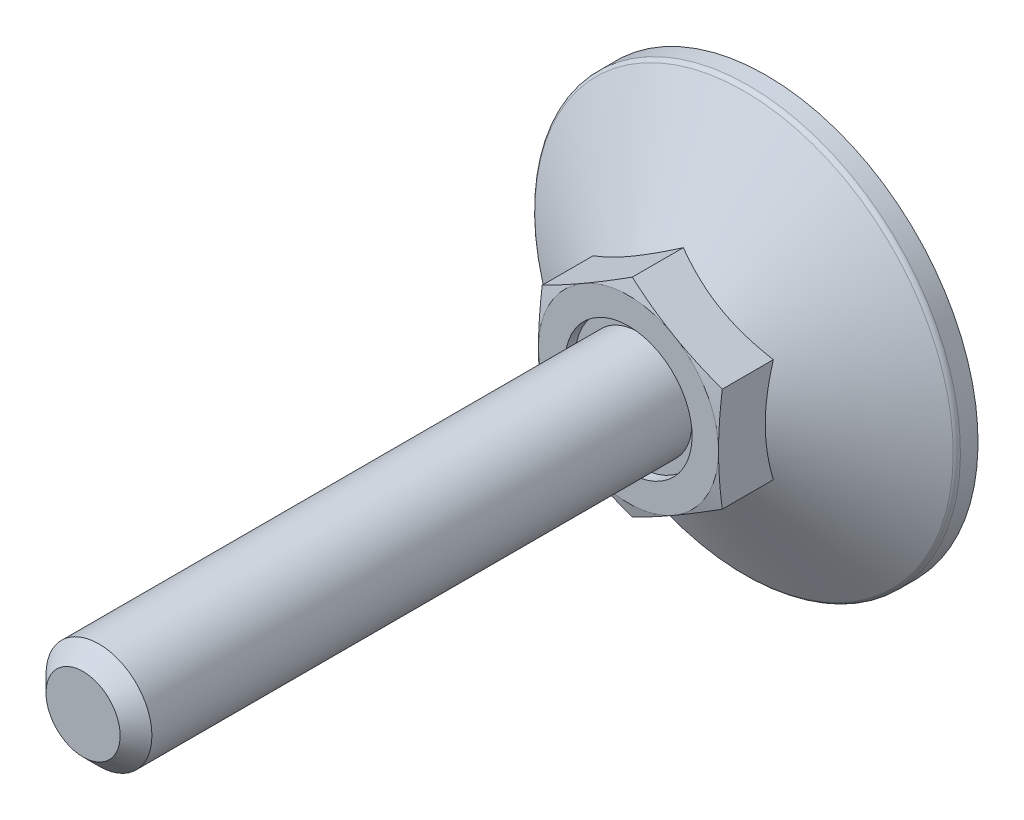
ISO-10303-21;
HEADER;
FILE_DESCRIPTION(('STEP AP214'),'2;1');
FILE_NAME('part.step','',(''),(''),'','','');
FILE_SCHEMA(('AUTOMOTIVE_DESIGN { 1 0 10303 214 1 1 1 1 }'));
ENDSEC;
DATA;
#1=APPLICATION_CONTEXT('core data for automotive mechanical design processes');
#2=APPLICATION_PROTOCOL_DEFINITION('international standard','automotive_design',2000,#1);
#3=PRODUCT_CONTEXT('',#1,'mechanical');
#4=PRODUCT('Part','Part','',(#3));
#5=PRODUCT_RELATED_PRODUCT_CATEGORY('part','',(#4));
#6=PRODUCT_DEFINITION_FORMATION('','',#4);
#7=PRODUCT_DEFINITION_CONTEXT('part definition',#1,'design');
#8=PRODUCT_DEFINITION('design','',#6,#7);
#9=PRODUCT_DEFINITION_SHAPE('','',#8);
#10=(LENGTH_UNIT() NAMED_UNIT(*) SI_UNIT(.MILLI.,.METRE.));
#11=(NAMED_UNIT(*) PLANE_ANGLE_UNIT() SI_UNIT($,.RADIAN.));
#12=(NAMED_UNIT(*) SI_UNIT($,.STERADIAN.) SOLID_ANGLE_UNIT());
#13=UNCERTAINTY_MEASURE_WITH_UNIT(LENGTH_MEASURE(1.E-05),#10,'distance_accuracy_value','');
#14=(GEOMETRIC_REPRESENTATION_CONTEXT(3) GLOBAL_UNCERTAINTY_ASSIGNED_CONTEXT((#13)) GLOBAL_UNIT_ASSIGNED_CONTEXT((#10,
#11,#12)) REPRESENTATION_CONTEXT('',''));
#15=CARTESIAN_POINT('',(0.,0.,0.));
#16=DIRECTION('',(0.,0.,1.));
#17=DIRECTION('',(1.,0.,0.));
#18=AXIS2_PLACEMENT_3D('',#15,#16,#17);
#19=CARTESIAN_POINT('',(10.2,0.,0.));
#20=DIRECTION('',(0.,0.,1.));
#21=DIRECTION('',(0.,-1.,0.));
#22=AXIS2_PLACEMENT_3D('',#19,#20,#21);
#23=PLANE('',#22);
#24=DIRECTION('',(1.,0.,0.));
#25=VECTOR('',#24,1.);
#26=CARTESIAN_POINT('',(1.,-1.,0.));
#27=LINE('',#26,#25);
#28=CARTESIAN_POINT('',(1.,-1.,0.));
#29=VERTEX_POINT('',#28);
#30=CARTESIAN_POINT('',(6.66666666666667,-1.,0.));
#31=VERTEX_POINT('',#30);
#32=EDGE_CURVE('E355',#29,#31,#27,.T.);
#33=ORIENTED_EDGE('',*,*,#32,.T.);
#34=DIRECTION('',(0.,-1.,0.));
#35=VECTOR('',#34,1.);
#36=CARTESIAN_POINT('',(6.66666666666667,0.,0.));
#37=LINE('',#36,#35);
#38=CARTESIAN_POINT('',(6.66666666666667,1.,0.));
#39=VERTEX_POINT('',#38);
#40=EDGE_CURVE('E375',#39,#31,#37,.T.);
#41=ORIENTED_EDGE('',*,*,#40,.F.);
#42=DIRECTION('',(-1.,0.,0.));
#43=VECTOR('',#42,1.);
#44=CARTESIAN_POINT('',(6.66666666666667,1.,0.));
#45=LINE('',#44,#43);
#46=CARTESIAN_POINT('',(1.,1.,0.));
#47=VERTEX_POINT('',#46);
#48=EDGE_CURVE('E659',#39,#47,#45,.T.);
#49=ORIENTED_EDGE('',*,*,#48,.T.);
#50=DIRECTION('',(0.,1.,0.));
#51=VECTOR('',#50,1.);
#52=CARTESIAN_POINT('',(1.,1.,0.));
#53=LINE('',#52,#51);
#54=CARTESIAN_POINT('',(1.,6.66666666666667,0.));
#55=VERTEX_POINT('',#54);
#56=EDGE_CURVE('E656',#47,#55,#53,.T.);
#57=ORIENTED_EDGE('',*,*,#56,.T.);
#58=DIRECTION('',(-1.,0.,0.));
#59=VECTOR('',#58,1.);
#60=CARTESIAN_POINT('',(1.,6.66666666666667,0.));
#61=LINE('',#60,#59);
#62=CARTESIAN_POINT('',(-1.,6.66666666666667,0.));
#63=VERTEX_POINT('',#62);
#64=EDGE_CURVE('E650',#55,#63,#61,.T.);
#65=ORIENTED_EDGE('',*,*,#64,.T.);
#66=DIRECTION('',(0.,-1.,0.));
#67=VECTOR('',#66,1.);
#68=CARTESIAN_POINT('',(-1.,6.66666666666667,0.));
#69=LINE('',#68,#67);
#70=CARTESIAN_POINT('',(-1.,1.,0.));
#71=VERTEX_POINT('',#70);
#72=EDGE_CURVE('E175',#63,#71,#69,.T.);
#73=ORIENTED_EDGE('',*,*,#72,.T.);
#74=DIRECTION('',(-1.,0.,0.));
#75=VECTOR('',#74,1.);
#76=CARTESIAN_POINT('',(-1.,1.,0.));
#77=LINE('',#76,#75);
#78=CARTESIAN_POINT('',(-6.66666666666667,1.,0.));
#79=VERTEX_POINT('',#78);
#80=EDGE_CURVE('E29',#71,#79,#77,.T.);
#81=ORIENTED_EDGE('',*,*,#80,.T.);
#82=DIRECTION('',(0.,-1.,0.));
#83=VECTOR('',#82,1.);
#84=CARTESIAN_POINT('',(-6.66666666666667,1.,0.));
#85=LINE('',#84,#83);
#86=CARTESIAN_POINT('',(-6.66666666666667,-1.,0.));
#87=VERTEX_POINT('',#86);
#88=EDGE_CURVE('E179',#79,#87,#85,.T.);
#89=ORIENTED_EDGE('',*,*,#88,.T.);
#90=DIRECTION('',(1.,0.,0.));
#91=VECTOR('',#90,1.);
#92=CARTESIAN_POINT('',(-6.66666666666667,-1.,0.));
#93=LINE('',#92,#91);
#94=CARTESIAN_POINT('',(-1.,-1.,0.));
#95=VERTEX_POINT('',#94);
#96=EDGE_CURVE('E684',#87,#95,#93,.T.);
#97=ORIENTED_EDGE('',*,*,#96,.T.);
#98=DIRECTION('',(0.,-1.,0.));
#99=VECTOR('',#98,1.);
#100=CARTESIAN_POINT('',(-1.,-1.,0.));
#101=LINE('',#100,#99);
#102=CARTESIAN_POINT('',(-1.,-6.66666666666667,0.));
#103=VERTEX_POINT('',#102);
#104=EDGE_CURVE('E686',#95,#103,#101,.T.);
#105=ORIENTED_EDGE('',*,*,#104,.T.);
#106=DIRECTION('',(1.,0.,0.));
#107=VECTOR('',#106,1.);
#108=CARTESIAN_POINT('',(-1.,-6.66666666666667,0.));
#109=LINE('',#108,#107);
#110=CARTESIAN_POINT('',(1.,-6.66666666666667,0.));
#111=VERTEX_POINT('',#110);
#112=EDGE_CURVE('E690',#103,#111,#109,.T.);
#113=ORIENTED_EDGE('',*,*,#112,.T.);
#114=DIRECTION('',(0.,1.,0.));
#115=VECTOR('',#114,1.);
#116=CARTESIAN_POINT('',(1.,-6.66666666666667,0.));
#117=LINE('',#116,#115);
#118=EDGE_CURVE('E697',#111,#29,#117,.T.);
#119=ORIENTED_EDGE('',*,*,#118,.T.);
#120=EDGE_LOOP('',(#33,#41,#49,#57,#65,#73,#81,#89,#97,#105,#113,#119));
#121=FACE_BOUND('',#120,.T.);
#122=CARTESIAN_POINT('',(0.,0.,0.));
#123=DIRECTION('',(0.,0.,-1.));
#124=DIRECTION('',(0.,1.,0.));
#125=AXIS2_PLACEMENT_3D('',#122,#123,#124);
#126=CIRCLE('',#125,20.);
#127=CARTESIAN_POINT('',(0.,20.,0.));
#128=VERTEX_POINT('',#127);
#129=EDGE_CURVE('E184',#128,#128,#126,.T.);
#130=ORIENTED_EDGE('',*,*,#129,.T.);
#131=EDGE_LOOP('',(#130));
#132=FACE_BOUND('',#131,.T.);
#133=ADVANCED_FACE('F14',(#121,#132),#23,.F.);
#134=CARTESIAN_POINT('',(0.,0.,12.025));
#135=DIRECTION('',(0.,0.,-1.));
#136=DIRECTION('',(0.,1.,0.));
#137=AXIS2_PLACEMENT_3D('',#134,#135,#136);
#138=PLANE('',#137);
#139=CARTESIAN_POINT('',(0.,0.,12.025));
#140=DIRECTION('',(0.,0.,-1.));
#141=DIRECTION('',(0.,1.,0.));
#142=AXIS2_PLACEMENT_3D('',#139,#140,#141);
#143=CIRCLE('',#142,6.);
#144=CARTESIAN_POINT('',(0.,6.,12.025));
#145=VERTEX_POINT('',#144);
#146=EDGE_CURVE('E376',#145,#145,#143,.T.);
#147=ORIENTED_EDGE('',*,*,#146,.F.);
#148=EDGE_LOOP('',(#147));
#149=FACE_BOUND('',#148,.T.);
#150=CARTESIAN_POINT('',(0.,0.,12.025));
#151=DIRECTION('',(0.,0.,-1.));
#152=DIRECTION('',(0.,1.,0.));
#153=AXIS2_PLACEMENT_3D('',#150,#151,#152);
#154=CIRCLE('',#153,5.);
#155=CARTESIAN_POINT('',(0.,5.,12.025));
#156=VERTEX_POINT('',#155);
#157=EDGE_CURVE('E180',#156,#156,#154,.F.);
#158=ORIENTED_EDGE('',*,*,#157,.F.);
#159=EDGE_LOOP('',(#158));
#160=FACE_BOUND('',#159,.T.);
#161=ADVANCED_FACE('F343',(#149,#160),#138,.F.);
#162=CARTESIAN_POINT('',(0.,9.81495457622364,39.));
#163=DIRECTION('',(0.5,-0.866025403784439,0.));
#164=DIRECTION('',(0.866025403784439,0.5,0.));
#165=AXIS2_PLACEMENT_3D('',#162,#163,#164);
#166=PLANE('',#165);
#167=CARTESIAN_POINT('',(-8.5002,4.90736181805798,7.83027204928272));
#168=CARTESIAN_POINT('',(-8.31336077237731,5.01523349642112,7.89254195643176));
#169=CARTESIAN_POINT('',(-8.1258249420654,5.1235073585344,7.95198579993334));
#170=CARTESIAN_POINT('',(-7.74923024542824,5.34093440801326,8.06444298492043));
#171=CARTESIAN_POINT('',(-7.56017075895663,5.45008795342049,8.1174535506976));
#172=CARTESIAN_POINT('',(-6.9899652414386,5.77929626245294,8.26579470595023));
#173=CARTESIAN_POINT('',(-6.60656835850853,6.00065055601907,8.3501691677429));
#174=CARTESIAN_POINT('',(-6.03282233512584,6.33190297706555,8.44910807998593));
#175=CARTESIAN_POINT('',(-5.84418723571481,6.44081150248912,8.47729289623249));
#176=CARTESIAN_POINT('',(-5.46606397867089,6.65912106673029,8.52455401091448));
#177=CARTESIAN_POINT('',(-5.27657589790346,6.76852206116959,8.54363111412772));
#178=CARTESIAN_POINT('',(-4.8972734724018,6.98751241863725,8.57219332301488));
#179=CARTESIAN_POINT('',(-4.7074597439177,7.09710142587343,8.58168931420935));
#180=CARTESIAN_POINT('',(-4.32765694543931,7.3163806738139,8.59088571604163));
#181=CARTESIAN_POINT('',(-4.13766788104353,7.42607091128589,8.59058642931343));
#182=CARTESIAN_POINT('',(-3.78247698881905,7.63114046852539,8.58087362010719));
#183=CARTESIAN_POINT('',(-3.6172500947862,7.72653426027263,8.57264492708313));
#184=CARTESIAN_POINT('',(-3.28718328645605,7.9170984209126,8.54893885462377));
#185=CARTESIAN_POINT('',(-3.12234339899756,8.01226877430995,8.53346098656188));
#186=CARTESIAN_POINT('',(-2.62846189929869,8.29741139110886,8.47651947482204));
#187=CARTESIAN_POINT('',(-2.30029449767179,8.48687892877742,8.42455503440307));
#188=CARTESIAN_POINT('',(-1.64047857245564,8.86782383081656,8.29464315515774));
#189=CARTESIAN_POINT('',(-1.30891425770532,9.05925257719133,8.21614502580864));
#190=CARTESIAN_POINT('',(-0.650730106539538,9.43925537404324,8.03798675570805));
#191=CARTESIAN_POINT('',(-0.324101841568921,9.62783429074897,7.93836845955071));
#192=CARTESIAN_POINT('',(0.000199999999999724,9.81507004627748,7.83027204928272));
#193=B_SPLINE_CURVE_WITH_KNOTS('',3,(#167,#168,#169,#170,#171,#172,#173,#174,#175,#176,#177,
#178,#179,#180,#181,#182,#183,#184,#185,#186,#187,#188,#189,#190,#191,#192),.UNSPECIFIED.,.F.,
.F.,(4,2,2,2,2,2,2,2,2,2,2,2,4),(0.,0.673596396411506,1.34748239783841,2.69805431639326,
3.356799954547,4.01548737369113,4.67342558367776,5.33134346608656,5.90409556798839,
6.47688628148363,7.62328361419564,8.79510569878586,9.9646274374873),.UNSPECIFIED.);
#194=CARTESIAN_POINT('',(-8.5,4.90747728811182,7.83033871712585));
#195=VERTEX_POINT('',#194);
#196=CARTESIAN_POINT('',(0.,9.81495457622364,7.83033871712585));
#197=VERTEX_POINT('',#196);
#198=EDGE_CURVE('E254',#195,#197,#193,.T.);
#199=ORIENTED_EDGE('',*,*,#198,.F.);
#200=DIRECTION('',(0.,0.,-1.));
#201=VECTOR('',#200,1.);
#202=CARTESIAN_POINT('',(-8.5,4.90747728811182,39.));
#203=LINE('',#202,#201);
#204=CARTESIAN_POINT('',(-8.5,4.90747728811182,12.6476589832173));
#205=VERTEX_POINT('',#204);
#206=EDGE_CURVE('E429',#205,#195,#203,.T.);
#207=ORIENTED_EDGE('',*,*,#206,.F.);
#208=CARTESIAN_POINT('',(0.000200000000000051,9.81507004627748,12.6476280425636));
#209=CARTESIAN_POINT('',(-0.352800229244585,9.61126526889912,12.7022599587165));
#210=CARTESIAN_POINT('',(-0.706440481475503,9.40709097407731,12.7518566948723));
#211=CARTESIAN_POINT('',(-1.41496987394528,8.99802133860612,12.8389934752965));
#212=CARTESIAN_POINT('',(-1.76985946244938,8.79312573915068,12.8765286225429));
#213=CARTESIAN_POINT('',(-2.47873586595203,8.38385575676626,12.9373509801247));
#214=CARTESIAN_POINT('',(-2.83271788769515,8.17948414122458,12.9607107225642));
#215=CARTESIAN_POINT('',(-3.5411333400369,7.77048028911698,12.9920337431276));
#216=CARTESIAN_POINT('',(-3.89556667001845,7.56584811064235,13.));
#217=CARTESIAN_POINT('',(-4.60443332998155,7.15658375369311,13.));
#218=CARTESIAN_POINT('',(-4.9588666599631,6.95195157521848,12.9920337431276));
#219=CARTESIAN_POINT('',(-5.66728211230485,6.54294772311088,12.9607107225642));
#220=CARTESIAN_POINT('',(-6.02126413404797,6.33857610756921,12.9373509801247));
#221=CARTESIAN_POINT('',(-6.73014053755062,5.92930612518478,12.8765286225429));
#222=CARTESIAN_POINT('',(-7.08503012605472,5.72441052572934,12.8389934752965));
#223=CARTESIAN_POINT('',(-7.7935595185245,5.31534089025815,12.7518566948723));
#224=CARTESIAN_POINT('',(-8.14719977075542,5.11116659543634,12.7022599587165));
#225=CARTESIAN_POINT('',(-8.5002,4.90736181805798,12.6476280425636));
#226=B_SPLINE_CURVE_WITH_KNOTS('',3,(#208,#209,#210,#211,#212,#213,#214,#215,#216,#217,#218,
#219,#220,#221,#222,#223,#224,#225),.UNSPECIFIED.,.F.,.F.,(4,2,2,2,2,2,2,2,4),(0.,
1.23382789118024,2.46815608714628,3.69611406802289,4.92383440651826,6.15155474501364,
7.37951272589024,8.61384092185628,9.84766881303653),.UNSPECIFIED.);
#227=CARTESIAN_POINT('',(-4.25,7.36121593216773,13.));
#228=VERTEX_POINT('',#227);
#229=EDGE_CURVE('E284',#228,#205,#226,.T.);
#230=ORIENTED_EDGE('',*,*,#229,.F.);
#231=CARTESIAN_POINT('',(0.,9.81495457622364,12.6476589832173));
#232=VERTEX_POINT('',#231);
#233=EDGE_CURVE('E394',#232,#228,#226,.T.);
#234=ORIENTED_EDGE('',*,*,#233,.F.);
#235=DIRECTION('',(0.,0.,-1.));
#236=VECTOR('',#235,1.);
#237=CARTESIAN_POINT('',(0.,9.81495457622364,39.));
#238=LINE('',#237,#236);
#239=EDGE_CURVE('E415',#232,#197,#238,.T.);
#240=ORIENTED_EDGE('',*,*,#239,.T.);
#241=EDGE_LOOP('',(#199,#207,#230,#234,#240));
#242=FACE_BOUND('',#241,.T.);
#243=ADVANCED_FACE('F226',(#242),#166,.F.);
#244=CARTESIAN_POINT('',(8.5,4.90747728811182,39.));
#245=DIRECTION('',(-0.5,-0.866025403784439,0.));
#246=DIRECTION('',(0.866025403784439,-0.5,0.));
#247=AXIS2_PLACEMENT_3D('',#244,#245,#246);
#248=PLANE('',#247);
#249=CARTESIAN_POINT('',(-0.0002,9.81507004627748,7.83027204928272));
#250=CARTESIAN_POINT('',(0.186639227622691,9.70719836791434,7.89254195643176));
#251=CARTESIAN_POINT('',(0.374175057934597,9.59892450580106,7.95198579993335));
#252=CARTESIAN_POINT('',(0.750769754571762,9.3814974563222,8.06444298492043));
#253=CARTESIAN_POINT('',(0.939829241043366,9.27234391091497,8.1174535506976));
#254=CARTESIAN_POINT('',(1.5100347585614,8.94313560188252,8.26579470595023));
#255=CARTESIAN_POINT('',(1.89343164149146,8.72178130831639,8.3501691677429));
#256=CARTESIAN_POINT('',(2.46717766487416,8.39052888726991,8.44910807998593));
#257=CARTESIAN_POINT('',(2.65581276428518,8.28162036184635,8.47729289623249));
#258=CARTESIAN_POINT('',(3.03393602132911,8.06331079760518,8.52455401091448));
#259=CARTESIAN_POINT('',(3.22342410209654,7.95390980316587,8.54363111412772));
#260=CARTESIAN_POINT('',(3.6027265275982,7.73491944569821,8.57219332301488));
#261=CARTESIAN_POINT('',(3.79254025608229,7.62533043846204,8.58168931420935));
#262=CARTESIAN_POINT('',(4.17234305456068,7.40605119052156,8.59088571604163));
#263=CARTESIAN_POINT('',(4.36233211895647,7.29636095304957,8.59058642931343));
#264=CARTESIAN_POINT('',(4.71752301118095,7.09129139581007,8.58087362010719));
#265=CARTESIAN_POINT('',(4.8827499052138,6.99589760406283,8.57264492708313));
#266=CARTESIAN_POINT('',(5.21281671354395,6.80533344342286,8.54893885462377));
#267=CARTESIAN_POINT('',(5.37765660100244,6.71016309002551,8.53346098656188));
#268=CARTESIAN_POINT('',(5.87153810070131,6.42502047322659,8.47651947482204));
#269=CARTESIAN_POINT('',(6.19970550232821,6.23555293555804,8.42455503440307));
#270=CARTESIAN_POINT('',(6.85952142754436,5.8546080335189,8.29464315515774));
#271=CARTESIAN_POINT('',(7.19108574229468,5.66317928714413,8.21614502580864));
#272=CARTESIAN_POINT('',(7.84926989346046,5.28317649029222,8.03798675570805));
#273=CARTESIAN_POINT('',(8.17589815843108,5.09459757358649,7.93836845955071));
#274=CARTESIAN_POINT('',(8.5002,4.90736181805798,7.83027204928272));
#275=B_SPLINE_CURVE_WITH_KNOTS('',3,(#249,#250,#251,#252,#253,#254,#255,#256,#257,#258,#259,
#260,#261,#262,#263,#264,#265,#266,#267,#268,#269,#270,#271,#272,#273,#274),.UNSPECIFIED.,.F.,
.F.,(4,2,2,2,2,2,2,2,2,2,2,2,4),(0.,0.673596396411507,1.34748239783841,2.69805431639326,
3.35679995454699,4.01548737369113,4.67342558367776,5.33134346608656,5.90409556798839,
6.47688628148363,7.62328361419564,8.79510569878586,9.9646274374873),.UNSPECIFIED.);
#276=CARTESIAN_POINT('',(8.5,4.90747728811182,7.83033871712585));
#277=VERTEX_POINT('',#276);
#278=EDGE_CURVE('E37',#197,#277,#275,.T.);
#279=ORIENTED_EDGE('',*,*,#278,.F.);
#280=ORIENTED_EDGE('',*,*,#239,.F.);
#281=CARTESIAN_POINT('',(8.5002,4.90736181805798,12.6476280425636));
#282=CARTESIAN_POINT('',(8.14719977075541,5.11116659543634,12.7022599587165));
#283=CARTESIAN_POINT('',(7.7935595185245,5.31534089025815,12.7518566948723));
#284=CARTESIAN_POINT('',(7.08503012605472,5.72441052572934,12.8389934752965));
#285=CARTESIAN_POINT('',(6.73014053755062,5.92930612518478,12.8765286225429));
#286=CARTESIAN_POINT('',(6.02126413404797,6.33857610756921,12.9373509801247));
#287=CARTESIAN_POINT('',(5.66728211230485,6.54294772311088,12.9607107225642));
#288=CARTESIAN_POINT('',(4.9588666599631,6.95195157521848,12.9920337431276));
#289=CARTESIAN_POINT('',(4.60443332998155,7.15658375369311,13.));
#290=CARTESIAN_POINT('',(3.89556667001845,7.56584811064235,13.));
#291=CARTESIAN_POINT('',(3.5411333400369,7.77048028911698,12.9920337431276));
#292=CARTESIAN_POINT('',(2.83271788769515,8.17948414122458,12.9607107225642));
#293=CARTESIAN_POINT('',(2.47873586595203,8.38385575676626,12.9373509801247));
#294=CARTESIAN_POINT('',(1.76985946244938,8.79312573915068,12.8765286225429));
#295=CARTESIAN_POINT('',(1.41496987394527,8.99802133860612,12.8389934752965));
#296=CARTESIAN_POINT('',(0.7064404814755,9.40709097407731,12.7518566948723));
#297=CARTESIAN_POINT('',(0.352800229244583,9.61126526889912,12.7022599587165));
#298=CARTESIAN_POINT('',(-0.000200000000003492,9.81507004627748,12.6476280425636));
#299=B_SPLINE_CURVE_WITH_KNOTS('',3,(#281,#282,#283,#284,#285,#286,#287,#288,#289,#290,#291,
#292,#293,#294,#295,#296,#297,#298),.UNSPECIFIED.,.F.,.F.,(4,2,2,2,2,2,2,2,4),(0.,
1.23382789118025,2.46815608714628,3.69611406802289,4.92383440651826,6.15155474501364,
7.37951272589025,8.61384092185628,9.84766881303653),.UNSPECIFIED.);
#300=CARTESIAN_POINT('',(4.25,7.36121593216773,13.));
#301=VERTEX_POINT('',#300);
#302=EDGE_CURVE('E267',#301,#232,#299,.T.);
#303=ORIENTED_EDGE('',*,*,#302,.F.);
#304=CARTESIAN_POINT('',(8.5,4.90747728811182,12.6476589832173));
#305=VERTEX_POINT('',#304);
#306=EDGE_CURVE('E276',#305,#301,#299,.T.);
#307=ORIENTED_EDGE('',*,*,#306,.F.);
#308=DIRECTION('',(0.,0.,-1.));
#309=VECTOR('',#308,1.);
#310=CARTESIAN_POINT('',(8.5,4.90747728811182,39.));
#311=LINE('',#310,#309);
#312=EDGE_CURVE('E417',#305,#277,#311,.T.);
#313=ORIENTED_EDGE('',*,*,#312,.T.);
#314=EDGE_LOOP('',(#279,#280,#303,#307,#313));
#315=FACE_BOUND('',#314,.T.);
#316=ADVANCED_FACE('F260',(#315),#248,.F.);
#317=CARTESIAN_POINT('',(8.5,-4.90747728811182,39.));
#318=DIRECTION('',(-1.,0.,0.));
#319=DIRECTION('',(0.,-1.,0.));
#320=AXIS2_PLACEMENT_3D('',#317,#318,#319);
#321=PLANE('',#320);
#322=CARTESIAN_POINT('',(8.5,12.8220542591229,4.61528116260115));
#323=CARTESIAN_POINT('',(8.5,12.4534155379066,4.79262377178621));
#324=CARTESIAN_POINT('',(8.5,12.0838902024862,4.96815716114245));
#325=CARTESIAN_POINT('',(8.5,11.3425927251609,5.31457894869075));
#326=CARTESIAN_POINT('',(8.5,10.9708202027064,5.48546653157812));
#327=CARTESIAN_POINT('',(8.5,10.2224625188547,5.82250763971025));
#328=CARTESIAN_POINT('',(8.5,9.84586188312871,5.98862693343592));
#329=CARTESIAN_POINT('',(8.5,9.08953299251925,6.31355867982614));
#330=CARTESIAN_POINT('',(8.5,8.70980489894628,6.47237150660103));
#331=CARTESIAN_POINT('',(8.5,7.93635853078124,6.78489169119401));
#332=CARTESIAN_POINT('',(8.5,7.5425381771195,6.93834789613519));
#333=CARTESIAN_POINT('',(8.5,6.75016193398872,7.23275009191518));
#334=CARTESIAN_POINT('',(8.5,6.35160550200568,7.37369463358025));
#335=CARTESIAN_POINT('',(8.5,5.54998630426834,7.63911020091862));
#336=CARTESIAN_POINT('',(8.5,5.14693580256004,7.76361784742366));
#337=CARTESIAN_POINT('',(8.5,4.33508769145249,7.99193558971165));
#338=CARTESIAN_POINT('',(8.5,3.92629204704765,8.09575258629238));
#339=CARTESIAN_POINT('',(8.5,3.10458766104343,8.27700176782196));
#340=CARTESIAN_POINT('',(8.5,2.69170444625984,8.35454642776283));
#341=CARTESIAN_POINT('',(8.5,2.06892742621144,8.44757828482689));
#342=CARTESIAN_POINT('',(8.5,1.86074253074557,8.47470931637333));
#343=CARTESIAN_POINT('',(8.5,1.44346514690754,8.52067173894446));
#344=CARTESIAN_POINT('',(8.5,1.23437274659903,8.5395039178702));
#345=CARTESIAN_POINT('',(8.5,0.818123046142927,8.5682751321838));
#346=CARTESIAN_POINT('',(8.5,0.6109730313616,8.57831925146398));
#347=CARTESIAN_POINT('',(8.5,0.196434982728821,8.58967320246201));
#348=CARTESIAN_POINT('',(8.5,-0.0109530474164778,8.59098316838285));
#349=CARTESIAN_POINT('',(8.5,-0.425608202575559,8.58483724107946));
#350=CARTESIAN_POINT('',(8.5,-0.632875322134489,8.57738097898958));
#351=CARTESIAN_POINT('',(8.5,-1.04692490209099,8.55387613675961));
#352=CARTESIAN_POINT('',(8.5,-1.25370733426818,8.5378270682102));
#353=CARTESIAN_POINT('',(8.5,-1.76172684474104,8.48816674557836));
#354=CARTESIAN_POINT('',(8.5,-2.06251418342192,8.44986872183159));
#355=CARTESIAN_POINT('',(8.5,-2.66160170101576,8.35726697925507));
#356=CARTESIAN_POINT('',(8.5,-2.95990148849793,8.30296078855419));
#357=CARTESIAN_POINT('',(8.5,-3.85084347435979,8.11893322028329));
#358=CARTESIAN_POINT('',(8.5,-4.4391769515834,7.96814146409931));
#359=CARTESIAN_POINT('',(8.5,-5.31919968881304,7.70971639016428));
#360=CARTESIAN_POINT('',(8.5,-5.61551051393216,7.61694416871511));
#361=CARTESIAN_POINT('',(8.5,-6.20524874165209,7.4225646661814));
#362=CARTESIAN_POINT('',(8.5,-6.4986761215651,7.3209573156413));
#363=CARTESIAN_POINT('',(8.5,-7.08276471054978,7.11046965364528));
#364=CARTESIAN_POINT('',(8.5,-7.37342689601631,7.0015920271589));
#365=CARTESIAN_POINT('',(8.5,-7.95239195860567,6.77777126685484));
#366=CARTESIAN_POINT('',(8.5,-8.2406948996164,6.66282829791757));
#367=CARTESIAN_POINT('',(8.5,-8.80562449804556,6.43181846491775));
#368=CARTESIAN_POINT('',(8.5,-9.08231928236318,6.31591764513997));
#369=CARTESIAN_POINT('',(8.5,-9.63401072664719,6.0801365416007));
#370=CARTESIAN_POINT('',(8.5,-9.90900735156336,5.96025617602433));
#371=CARTESIAN_POINT('',(8.5,-10.7318217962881,5.59557173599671));
#372=CARTESIAN_POINT('',(8.5,-11.2774137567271,5.34574521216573));
#373=CARTESIAN_POINT('',(8.5,-12.3642460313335,4.83628492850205));
#374=CARTESIAN_POINT('',(8.5,-12.905484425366,4.57664710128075));
#375=CARTESIAN_POINT('',(8.5,-13.9843891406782,4.05013469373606));
#376=CARTESIAN_POINT('',(8.5,-14.5220556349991,3.78326046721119));
#377=CARTESIAN_POINT('',(8.5,-15.5954930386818,3.24355438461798));
#378=CARTESIAN_POINT('',(8.5,-16.1312593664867,2.97071343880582));
#379=CARTESIAN_POINT('',(8.5,-17.2005865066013,2.4207361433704));
#380=CARTESIAN_POINT('',(8.5,-17.7341472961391,2.14359974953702));
#381=CARTESIAN_POINT('',(8.5,-18.7993643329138,1.58600707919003));
#382=CARTESIAN_POINT('',(8.5,-19.3310210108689,1.30555162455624));
#383=CARTESIAN_POINT('',(8.5,-20.3928917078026,0.741921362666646));
#384=CARTESIAN_POINT('',(8.5,-20.9231057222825,0.458746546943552));
#385=CARTESIAN_POINT('',(8.5,-22.3874236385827,-0.32722037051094));
#386=CARTESIAN_POINT('',(8.5,-23.3202800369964,-0.83233607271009));
#387=CARTESIAN_POINT('',(8.5,-25.1833983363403,-1.84747335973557));
#388=CARTESIAN_POINT('',(8.5,-26.1136600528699,-2.35749528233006));
#389=CARTESIAN_POINT('',(8.5,-27.9692131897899,-3.37950461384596));
#390=CARTESIAN_POINT('',(8.5,-28.8945109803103,-3.89148046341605));
#391=CARTESIAN_POINT('',(8.5,-30.2812847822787,-4.66146611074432));
#392=CARTESIAN_POINT('',(8.5,-30.7433285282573,-4.91845451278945));
#393=CARTESIAN_POINT('',(8.5,-31.6670795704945,-5.43303439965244));
#394=CARTESIAN_POINT('',(8.5,-32.1287868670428,-5.69062588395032));
#395=CARTESIAN_POINT('',(8.5,-32.5903473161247,-5.94848028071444));
#396=B_SPLINE_CURVE_WITH_KNOTS('',3,(#322,#323,#324,#325,#326,#327,#328,#329,#330,#331,#332,
#333,#334,#335,#336,#337,#338,#339,#340,#341,#342,#343,#344,#345,#346,#347,#348,#349,#350,#351,
#352,#353,#354,#355,#356,#357,#358,#359,#360,#361,#362,#363,#364,#365,#366,#367,#368,#369,#370,
#371,#372,#373,#374,#375,#376,#377,#378,#379,#380,#381,#382,#383,#384,#385,#386,#387,#388,#389,
#390,#391,#392,#393,#394,#395),.UNSPECIFIED.,.F.,.F.,(4,2,2,2,2,2,2,2,2,2,2,2,2,2,2,2,2,2,2,2,2,
2,2,2,2,2,2,2,2,2,2,2,2,2,2,2,4),(0.,1.22725127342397,2.45471654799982,3.68948778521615,
4.92419572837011,6.19201746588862,7.45998585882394,8.72507978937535,9.98975107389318,
11.2489376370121,11.878634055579,12.5082706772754,13.1302712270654,13.7522622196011,
14.3742793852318,14.9963319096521,15.9054589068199,16.814726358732,18.6343169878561,
19.5657329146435,20.4971561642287,21.4282373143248,22.3592931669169,23.259222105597,
24.1591695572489,25.9592281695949,27.7600413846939,29.5607667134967,31.3644583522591,
33.1681685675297,34.9714411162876,36.7747192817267,39.9571898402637,43.1398810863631,
46.3123590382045,47.8984694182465,49.4845784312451),.UNSPECIFIED.);
#397=CARTESIAN_POINT('',(8.5,-4.90747728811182,7.83033871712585));
#398=VERTEX_POINT('',#397);
#399=EDGE_CURVE('E243',#277,#398,#396,.T.);
#400=ORIENTED_EDGE('',*,*,#399,.F.);
#401=ORIENTED_EDGE('',*,*,#312,.F.);
#402=CARTESIAN_POINT('',(8.5,12.9820891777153,11.1197370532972));
#403=CARTESIAN_POINT('',(8.5,12.5964686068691,11.2061594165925));
#404=CARTESIAN_POINT('',(8.5,12.2106068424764,11.2915248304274));
#405=CARTESIAN_POINT('',(8.5,11.4382824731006,11.4595712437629));
#406=CARTESIAN_POINT('',(8.5,11.0518198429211,11.5422521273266));
#407=CARTESIAN_POINT('',(8.5,10.2778290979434,11.7044309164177));
#408=CARTESIAN_POINT('',(8.5,9.89030030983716,11.7839256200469));
#409=CARTESIAN_POINT('',(8.5,9.11443612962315,11.9388739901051));
#410=CARTESIAN_POINT('',(8.5,8.72610074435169,12.0143276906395));
#411=CARTESIAN_POINT('',(8.5,7.95158013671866,12.159650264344));
#412=CARTESIAN_POINT('',(8.5,7.56540239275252,12.2295587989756));
#413=CARTESIAN_POINT('',(8.5,6.79199352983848,12.3632725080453));
#414=CARTESIAN_POINT('',(8.5,6.40476243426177,12.4270778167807));
#415=CARTESIAN_POINT('',(8.5,5.62917169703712,12.54714843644));
#416=CARTESIAN_POINT('',(8.5,5.24081220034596,12.6034146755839));
#417=CARTESIAN_POINT('',(8.5,4.46285737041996,12.70674908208));
#418=CARTESIAN_POINT('',(8.5,4.07326203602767,12.7538172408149));
#419=CARTESIAN_POINT('',(8.5,3.28844017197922,12.8374226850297));
#420=CARTESIAN_POINT('',(8.5,2.89320002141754,12.8738340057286));
#421=CARTESIAN_POINT('',(8.5,2.10172608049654,12.9336139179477));
#422=CARTESIAN_POINT('',(8.5,1.70549231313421,12.9569828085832));
#423=CARTESIAN_POINT('',(8.5,0.912605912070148,12.9893148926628));
#424=CARTESIAN_POINT('',(8.5,0.515953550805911,12.9982846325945));
#425=CARTESIAN_POINT('',(8.5,-0.27740821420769,13.0012669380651));
#426=CARTESIAN_POINT('',(8.5,-0.674117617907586,12.9952795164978));
#427=CARTESIAN_POINT('',(8.5,-1.46847963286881,12.9686842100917));
#428=CARTESIAN_POINT('',(8.5,-1.86613043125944,12.9480232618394));
#429=CARTESIAN_POINT('',(8.5,-2.66049684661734,12.8932602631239));
#430=CARTESIAN_POINT('',(8.5,-3.05721244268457,12.8591579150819));
#431=CARTESIAN_POINT('',(8.5,-3.84970511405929,12.7792347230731));
#432=CARTESIAN_POINT('',(8.5,-4.24548140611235,12.7334062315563));
#433=CARTESIAN_POINT('',(8.5,-5.03576028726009,12.6319377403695));
#434=CARTESIAN_POINT('',(8.5,-5.43026287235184,12.5762977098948));
#435=CARTESIAN_POINT('',(8.5,-6.19195385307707,12.4609360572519));
#436=CARTESIAN_POINT('',(8.5,-6.55922094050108,12.4017287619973));
#437=CARTESIAN_POINT('',(8.5,-7.29278719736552,12.2775674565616));
#438=CARTESIAN_POINT('',(8.5,-7.65908634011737,12.2126132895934));
#439=CARTESIAN_POINT('',(8.5,-8.39085027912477,12.078008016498));
#440=CARTESIAN_POINT('',(8.5,-8.75631499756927,12.0083564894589));
#441=CARTESIAN_POINT('',(8.5,-9.48649515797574,11.8652200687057));
#442=CARTESIAN_POINT('',(8.5,-9.85121059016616,11.7917351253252));
#443=CARTESIAN_POINT('',(8.5,-10.5800753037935,11.6416087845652));
#444=CARTESIAN_POINT('',(8.5,-10.944224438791,11.5649666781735));
#445=CARTESIAN_POINT('',(8.5,-11.6719684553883,11.4090909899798));
#446=CARTESIAN_POINT('',(8.5,-12.0355633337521,11.3298573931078));
#447=CARTESIAN_POINT('',(8.5,-13.1255915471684,11.0889686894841));
#448=CARTESIAN_POINT('',(8.5,-13.8513178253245,10.9241153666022));
#449=CARTESIAN_POINT('',(8.5,-15.2942598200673,10.590109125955));
#450=CARTESIAN_POINT('',(8.5,-16.0114890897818,10.421014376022));
#451=CARTESIAN_POINT('',(8.5,-17.4449475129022,10.0785875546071));
#452=CARTESIAN_POINT('',(8.5,-18.1611766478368,9.9052554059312));
#453=CARTESIAN_POINT('',(8.5,-19.5919856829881,9.55567998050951));
#454=CARTESIAN_POINT('',(8.5,-20.306566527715,9.37944056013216));
#455=CARTESIAN_POINT('',(8.5,-21.7351057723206,9.02455520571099));
#456=CARTESIAN_POINT('',(8.5,-22.4490641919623,8.84590935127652));
#457=CARTESIAN_POINT('',(8.5,-23.1628057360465,8.66641079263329));
#458=B_SPLINE_CURVE_WITH_KNOTS('',3,(#402,#403,#404,#405,#406,#407,#408,#409,#410,#411,#412,
#413,#414,#415,#416,#417,#418,#419,#420,#421,#422,#423,#424,#425,#426,#427,#428,#429,#430,#431,
#432,#433,#434,#435,#436,#437,#438,#439,#440,#441,#442,#443,#444,#445,#446,#447,#448,#449,#450,
#451,#452,#453,#454,#455,#456,#457),.UNSPECIFIED.,.F.,.F.,(4,2,2,2,2,2,2,2,2,2,2,2,2,2,2,2,2,2,
2,2,2,2,2,2,2,2,2,4),(0.,1.18556310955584,2.37117735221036,3.5579546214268,4.74472187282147,
5.92204594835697,7.09934411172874,8.27649719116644,9.45365137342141,10.6442044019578,
11.8347301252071,13.0247144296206,14.2146977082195,15.4090063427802,16.6033414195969,
17.7984574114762,18.9935771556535,20.1095500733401,21.2255534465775,22.3416569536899,
23.4577749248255,24.5741449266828,25.6905214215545,27.9231231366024,30.1337863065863,
32.3444897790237,34.5524651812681,36.7603677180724),.UNSPECIFIED.);
#459=CARTESIAN_POINT('',(8.5,0.,13.));
#460=VERTEX_POINT('',#459);
#461=EDGE_CURVE('E278',#460,#305,#458,.F.);
#462=ORIENTED_EDGE('',*,*,#461,.F.);
#463=CARTESIAN_POINT('',(8.5,-4.90747728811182,12.6476589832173));
#464=VERTEX_POINT('',#463);
#465=EDGE_CURVE('E277',#464,#460,#458,.F.);
#466=ORIENTED_EDGE('',*,*,#465,.F.);
#467=DIRECTION('',(0.,0.,-1.));
#468=VECTOR('',#467,1.);
#469=CARTESIAN_POINT('',(8.5,-4.90747728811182,39.));
#470=LINE('',#469,#468);
#471=EDGE_CURVE('E420',#464,#398,#470,.T.);
#472=ORIENTED_EDGE('',*,*,#471,.T.);
#473=EDGE_LOOP('',(#400,#401,#462,#466,#472));
#474=FACE_BOUND('',#473,.T.);
#475=ADVANCED_FACE('F263',(#474),#321,.F.);
#476=CARTESIAN_POINT('',(0.,-9.81495457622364,39.));
#477=DIRECTION('',(-0.5,0.866025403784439,0.));
#478=DIRECTION('',(-0.866025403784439,-0.5,0.));
#479=AXIS2_PLACEMENT_3D('',#476,#477,#478);
#480=PLANE('',#479);
#481=CARTESIAN_POINT('',(8.5002,-4.90736181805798,7.83027204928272));
#482=CARTESIAN_POINT('',(8.31336077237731,-5.01523349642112,7.89254195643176));
#483=CARTESIAN_POINT('',(8.1258249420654,-5.1235073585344,7.95198579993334));
#484=CARTESIAN_POINT('',(7.74923024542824,-5.34093440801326,8.06444298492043));
#485=CARTESIAN_POINT('',(7.56017075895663,-5.45008795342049,8.1174535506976));
#486=CARTESIAN_POINT('',(6.9899652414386,-5.77929626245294,8.26579470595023));
#487=CARTESIAN_POINT('',(6.60656835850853,-6.00065055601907,8.3501691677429));
#488=CARTESIAN_POINT('',(6.03282233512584,-6.33190297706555,8.44910807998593));
#489=CARTESIAN_POINT('',(5.84418723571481,-6.44081150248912,8.47729289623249));
#490=CARTESIAN_POINT('',(5.46606397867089,-6.65912106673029,8.52455401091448));
#491=CARTESIAN_POINT('',(5.27657589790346,-6.76852206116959,8.54363111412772));
#492=CARTESIAN_POINT('',(4.8972734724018,-6.98751241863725,8.57219332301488));
#493=CARTESIAN_POINT('',(4.7074597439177,-7.09710142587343,8.58168931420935));
#494=CARTESIAN_POINT('',(4.32765694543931,-7.3163806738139,8.59088571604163));
#495=CARTESIAN_POINT('',(4.13766788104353,-7.42607091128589,8.59058642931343));
#496=CARTESIAN_POINT('',(3.78247698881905,-7.63114046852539,8.58087362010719));
#497=CARTESIAN_POINT('',(3.6172500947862,-7.72653426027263,8.57264492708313));
#498=CARTESIAN_POINT('',(3.28718328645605,-7.9170984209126,8.54893885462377));
#499=CARTESIAN_POINT('',(3.12234339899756,-8.01226877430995,8.53346098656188));
#500=CARTESIAN_POINT('',(2.62846189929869,-8.29741139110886,8.47651947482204));
#501=CARTESIAN_POINT('',(2.30029449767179,-8.48687892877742,8.42455503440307));
#502=CARTESIAN_POINT('',(1.64047857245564,-8.86782383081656,8.29464315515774));
#503=CARTESIAN_POINT('',(1.30891425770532,-9.05925257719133,8.21614502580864));
#504=CARTESIAN_POINT('',(0.650730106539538,-9.43925537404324,8.03798675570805));
#505=CARTESIAN_POINT('',(0.324101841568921,-9.62783429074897,7.93836845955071));
#506=CARTESIAN_POINT('',(-0.000199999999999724,-9.81507004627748,7.83027204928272));
#507=B_SPLINE_CURVE_WITH_KNOTS('',3,(#481,#482,#483,#484,#485,#486,#487,#488,#489,#490,#491,
#492,#493,#494,#495,#496,#497,#498,#499,#500,#501,#502,#503,#504,#505,#506),.UNSPECIFIED.,.F.,
.F.,(4,2,2,2,2,2,2,2,2,2,2,2,4),(0.,0.673596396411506,1.34748239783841,2.69805431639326,
3.356799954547,4.01548737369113,4.67342558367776,5.33134346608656,5.90409556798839,
6.47688628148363,7.62328361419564,8.79510569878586,9.9646274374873),.UNSPECIFIED.);
#508=CARTESIAN_POINT('',(0.,-9.81495457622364,7.83033871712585));
#509=VERTEX_POINT('',#508);
#510=EDGE_CURVE('E207',#398,#509,#507,.T.);
#511=ORIENTED_EDGE('',*,*,#510,.F.);
#512=ORIENTED_EDGE('',*,*,#471,.F.);
#513=CARTESIAN_POINT('',(-0.000200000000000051,-9.81507004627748,12.6476280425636));
#514=CARTESIAN_POINT('',(0.352800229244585,-9.61126526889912,12.7022599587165));
#515=CARTESIAN_POINT('',(0.706440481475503,-9.40709097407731,12.7518566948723));
#516=CARTESIAN_POINT('',(1.41496987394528,-8.99802133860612,12.8389934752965));
#517=CARTESIAN_POINT('',(1.76985946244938,-8.79312573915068,12.8765286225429));
#518=CARTESIAN_POINT('',(2.47873586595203,-8.38385575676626,12.9373509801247));
#519=CARTESIAN_POINT('',(2.83271788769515,-8.17948414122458,12.9607107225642));
#520=CARTESIAN_POINT('',(3.5411333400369,-7.77048028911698,12.9920337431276));
#521=CARTESIAN_POINT('',(3.89556667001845,-7.56584811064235,13.));
#522=CARTESIAN_POINT('',(4.60443332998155,-7.15658375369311,13.));
#523=CARTESIAN_POINT('',(4.9588666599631,-6.95195157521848,12.9920337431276));
#524=CARTESIAN_POINT('',(5.66728211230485,-6.54294772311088,12.9607107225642));
#525=CARTESIAN_POINT('',(6.02126413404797,-6.33857610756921,12.9373509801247));
#526=CARTESIAN_POINT('',(6.73014053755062,-5.92930612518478,12.8765286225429));
#527=CARTESIAN_POINT('',(7.08503012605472,-5.72441052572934,12.8389934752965));
#528=CARTESIAN_POINT('',(7.7935595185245,-5.31534089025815,12.7518566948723));
#529=CARTESIAN_POINT('',(8.14719977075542,-5.11116659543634,12.7022599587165));
#530=CARTESIAN_POINT('',(8.5002,-4.90736181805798,12.6476280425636));
#531=B_SPLINE_CURVE_WITH_KNOTS('',3,(#513,#514,#515,#516,#517,#518,#519,#520,#521,#522,#523,
#524,#525,#526,#527,#528,#529,#530),.UNSPECIFIED.,.F.,.F.,(4,2,2,2,2,2,2,2,4),(0.,
1.23382789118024,2.46815608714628,3.69611406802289,4.92383440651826,6.15155474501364,
7.37951272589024,8.61384092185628,9.84766881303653),.UNSPECIFIED.);
#532=CARTESIAN_POINT('',(4.25,-7.36121593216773,13.));
#533=VERTEX_POINT('',#532);
#534=EDGE_CURVE('E319',#533,#464,#531,.T.);
#535=ORIENTED_EDGE('',*,*,#534,.F.);
#536=CARTESIAN_POINT('',(0.,-9.81495457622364,12.6476589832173));
#537=VERTEX_POINT('',#536);
#538=EDGE_CURVE('E325',#537,#533,#531,.T.);
#539=ORIENTED_EDGE('',*,*,#538,.F.);
#540=DIRECTION('',(0.,0.,-1.));
#541=VECTOR('',#540,1.);
#542=CARTESIAN_POINT('',(0.,-9.81495457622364,39.));
#543=LINE('',#542,#541);
#544=EDGE_CURVE('E425',#537,#509,#543,.T.);
#545=ORIENTED_EDGE('',*,*,#544,.T.);
#546=EDGE_LOOP('',(#511,#512,#535,#539,#545));
#547=FACE_BOUND('',#546,.T.);
#548=ADVANCED_FACE('F327',(#547),#480,.F.);
#549=CARTESIAN_POINT('',(-8.5,-4.90747728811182,39.));
#550=DIRECTION('',(0.5,0.866025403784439,0.));
#551=DIRECTION('',(-0.866025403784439,0.5,0.));
#552=AXIS2_PLACEMENT_3D('',#549,#550,#551);
#553=PLANE('',#552);
#554=CARTESIAN_POINT('',(0.0002,-9.81507004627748,7.83027204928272));
#555=CARTESIAN_POINT('',(-0.186639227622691,-9.70719836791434,7.89254195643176));
#556=CARTESIAN_POINT('',(-0.374175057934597,-9.59892450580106,7.95198579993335));
#557=CARTESIAN_POINT('',(-0.750769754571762,-9.3814974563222,8.06444298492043));
#558=CARTESIAN_POINT('',(-0.939829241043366,-9.27234391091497,8.1174535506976));
#559=CARTESIAN_POINT('',(-1.5100347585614,-8.94313560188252,8.26579470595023));
#560=CARTESIAN_POINT('',(-1.89343164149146,-8.72178130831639,8.3501691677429));
#561=CARTESIAN_POINT('',(-2.46717766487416,-8.39052888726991,8.44910807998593));
#562=CARTESIAN_POINT('',(-2.65581276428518,-8.28162036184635,8.47729289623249));
#563=CARTESIAN_POINT('',(-3.03393602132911,-8.06331079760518,8.52455401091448));
#564=CARTESIAN_POINT('',(-3.22342410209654,-7.95390980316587,8.54363111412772));
#565=CARTESIAN_POINT('',(-3.6027265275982,-7.73491944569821,8.57219332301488));
#566=CARTESIAN_POINT('',(-3.79254025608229,-7.62533043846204,8.58168931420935));
#567=CARTESIAN_POINT('',(-4.17234305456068,-7.40605119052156,8.59088571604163));
#568=CARTESIAN_POINT('',(-4.36233211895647,-7.29636095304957,8.59058642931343));
#569=CARTESIAN_POINT('',(-4.71752301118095,-7.09129139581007,8.58087362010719));
#570=CARTESIAN_POINT('',(-4.8827499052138,-6.99589760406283,8.57264492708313));
#571=CARTESIAN_POINT('',(-5.21281671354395,-6.80533344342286,8.54893885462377));
#572=CARTESIAN_POINT('',(-5.37765660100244,-6.71016309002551,8.53346098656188));
#573=CARTESIAN_POINT('',(-5.87153810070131,-6.42502047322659,8.47651947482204));
#574=CARTESIAN_POINT('',(-6.19970550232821,-6.23555293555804,8.42455503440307));
#575=CARTESIAN_POINT('',(-6.85952142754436,-5.8546080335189,8.29464315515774));
#576=CARTESIAN_POINT('',(-7.19108574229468,-5.66317928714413,8.21614502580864));
#577=CARTESIAN_POINT('',(-7.84926989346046,-5.28317649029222,8.03798675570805));
#578=CARTESIAN_POINT('',(-8.17589815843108,-5.09459757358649,7.93836845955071));
#579=CARTESIAN_POINT('',(-8.5002,-4.90736181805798,7.83027204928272));
#580=B_SPLINE_CURVE_WITH_KNOTS('',3,(#554,#555,#556,#557,#558,#559,#560,#561,#562,#563,#564,
#565,#566,#567,#568,#569,#570,#571,#572,#573,#574,#575,#576,#577,#578,#579),.UNSPECIFIED.,.F.,
.F.,(4,2,2,2,2,2,2,2,2,2,2,2,4),(0.,0.673596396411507,1.34748239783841,2.69805431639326,
3.35679995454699,4.01548737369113,4.67342558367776,5.33134346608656,5.90409556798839,
6.47688628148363,7.62328361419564,8.79510569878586,9.9646274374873),.UNSPECIFIED.);
#581=CARTESIAN_POINT('',(-8.5,-4.90747728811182,7.83033871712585));
#582=VERTEX_POINT('',#581);
#583=EDGE_CURVE('E198',#509,#582,#580,.T.);
#584=ORIENTED_EDGE('',*,*,#583,.F.);
#585=ORIENTED_EDGE('',*,*,#544,.F.);
#586=CARTESIAN_POINT('',(-8.5002,-4.90736181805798,12.6476280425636));
#587=CARTESIAN_POINT('',(-8.14719977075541,-5.11116659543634,12.7022599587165));
#588=CARTESIAN_POINT('',(-7.7935595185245,-5.31534089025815,12.7518566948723));
#589=CARTESIAN_POINT('',(-7.08503012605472,-5.72441052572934,12.8389934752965));
#590=CARTESIAN_POINT('',(-6.73014053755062,-5.92930612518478,12.8765286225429));
#591=CARTESIAN_POINT('',(-6.02126413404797,-6.33857610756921,12.9373509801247));
#592=CARTESIAN_POINT('',(-5.66728211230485,-6.54294772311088,12.9607107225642));
#593=CARTESIAN_POINT('',(-4.9588666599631,-6.95195157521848,12.9920337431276));
#594=CARTESIAN_POINT('',(-4.60443332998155,-7.15658375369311,13.));
#595=CARTESIAN_POINT('',(-3.89556667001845,-7.56584811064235,13.));
#596=CARTESIAN_POINT('',(-3.5411333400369,-7.77048028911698,12.9920337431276));
#597=CARTESIAN_POINT('',(-2.83271788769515,-8.17948414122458,12.9607107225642));
#598=CARTESIAN_POINT('',(-2.47873586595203,-8.38385575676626,12.9373509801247));
#599=CARTESIAN_POINT('',(-1.76985946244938,-8.79312573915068,12.8765286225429));
#600=CARTESIAN_POINT('',(-1.41496987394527,-8.99802133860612,12.8389934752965));
#601=CARTESIAN_POINT('',(-0.7064404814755,-9.40709097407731,12.7518566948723));
#602=CARTESIAN_POINT('',(-0.352800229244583,-9.61126526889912,12.7022599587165));
#603=CARTESIAN_POINT('',(0.000200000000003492,-9.81507004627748,12.6476280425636));
#604=B_SPLINE_CURVE_WITH_KNOTS('',3,(#586,#587,#588,#589,#590,#591,#592,#593,#594,#595,#596,
#597,#598,#599,#600,#601,#602,#603),.UNSPECIFIED.,.F.,.F.,(4,2,2,2,2,2,2,2,4),(0.,
1.23382789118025,2.46815608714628,3.69611406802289,4.92383440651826,6.15155474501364,
7.37951272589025,8.61384092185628,9.84766881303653),.UNSPECIFIED.);
#605=CARTESIAN_POINT('',(-4.25,-7.36121593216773,13.));
#606=VERTEX_POINT('',#605);
#607=EDGE_CURVE('E313',#606,#537,#604,.T.);
#608=ORIENTED_EDGE('',*,*,#607,.F.);
#609=CARTESIAN_POINT('',(-8.5,-4.90747728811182,12.6476589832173));
#610=VERTEX_POINT('',#609);
#611=EDGE_CURVE('E326',#610,#606,#604,.T.);
#612=ORIENTED_EDGE('',*,*,#611,.F.);
#613=DIRECTION('',(0.,0.,-1.));
#614=VECTOR('',#613,1.);
#615=CARTESIAN_POINT('',(-8.5,-4.90747728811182,39.));
#616=LINE('',#615,#614);
#617=EDGE_CURVE('E428',#610,#582,#616,.T.);
#618=ORIENTED_EDGE('',*,*,#617,.T.);
#619=EDGE_LOOP('',(#584,#585,#608,#612,#618));
#620=FACE_BOUND('',#619,.T.);
#621=ADVANCED_FACE('F214',(#620),#553,.F.);
#622=CARTESIAN_POINT('',(-8.5,4.90747728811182,39.));
#623=DIRECTION('',(1.,0.,0.));
#624=DIRECTION('',(0.,1.,0.));
#625=AXIS2_PLACEMENT_3D('',#622,#623,#624);
#626=PLANE('',#625);
#627=CARTESIAN_POINT('',(-8.5,12.8220542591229,4.61528116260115));
#628=CARTESIAN_POINT('',(-8.5,12.4534155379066,4.79262377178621));
#629=CARTESIAN_POINT('',(-8.5,12.0838902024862,4.96815716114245));
#630=CARTESIAN_POINT('',(-8.5,11.3425927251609,5.31457894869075));
#631=CARTESIAN_POINT('',(-8.5,10.9708202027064,5.48546653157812));
#632=CARTESIAN_POINT('',(-8.5,10.2224625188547,5.82250763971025));
#633=CARTESIAN_POINT('',(-8.5,9.84586188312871,5.98862693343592));
#634=CARTESIAN_POINT('',(-8.5,9.08953299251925,6.31355867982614));
#635=CARTESIAN_POINT('',(-8.5,8.70980489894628,6.47237150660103));
#636=CARTESIAN_POINT('',(-8.5,7.93635853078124,6.78489169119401));
#637=CARTESIAN_POINT('',(-8.5,7.5425381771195,6.93834789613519));
#638=CARTESIAN_POINT('',(-8.5,6.75016193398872,7.23275009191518));
#639=CARTESIAN_POINT('',(-8.5,6.35160550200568,7.37369463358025));
#640=CARTESIAN_POINT('',(-8.5,5.54998630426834,7.63911020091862));
#641=CARTESIAN_POINT('',(-8.5,5.14693580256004,7.76361784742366));
#642=CARTESIAN_POINT('',(-8.5,4.33508769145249,7.99193558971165));
#643=CARTESIAN_POINT('',(-8.5,3.92629204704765,8.09575258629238));
#644=CARTESIAN_POINT('',(-8.5,3.10458766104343,8.27700176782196));
#645=CARTESIAN_POINT('',(-8.5,2.69170444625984,8.35454642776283));
#646=CARTESIAN_POINT('',(-8.5,2.06892742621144,8.44757828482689));
#647=CARTESIAN_POINT('',(-8.5,1.86074253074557,8.47470931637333));
#648=CARTESIAN_POINT('',(-8.5,1.44346514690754,8.52067173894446));
#649=CARTESIAN_POINT('',(-8.5,1.23437274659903,8.5395039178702));
#650=CARTESIAN_POINT('',(-8.5,0.818123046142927,8.5682751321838));
#651=CARTESIAN_POINT('',(-8.5,0.6109730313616,8.57831925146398));
#652=CARTESIAN_POINT('',(-8.5,0.196434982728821,8.58967320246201));
#653=CARTESIAN_POINT('',(-8.5,-0.0109530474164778,8.59098316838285));
#654=CARTESIAN_POINT('',(-8.5,-0.425608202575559,8.58483724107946));
#655=CARTESIAN_POINT('',(-8.5,-0.632875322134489,8.57738097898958));
#656=CARTESIAN_POINT('',(-8.5,-1.04692490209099,8.55387613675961));
#657=CARTESIAN_POINT('',(-8.5,-1.25370733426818,8.5378270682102));
#658=CARTESIAN_POINT('',(-8.5,-1.76172684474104,8.48816674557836));
#659=CARTESIAN_POINT('',(-8.5,-2.06251418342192,8.44986872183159));
#660=CARTESIAN_POINT('',(-8.5,-2.66160170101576,8.35726697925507));
#661=CARTESIAN_POINT('',(-8.5,-2.95990148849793,8.30296078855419));
#662=CARTESIAN_POINT('',(-8.5,-3.85084347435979,8.11893322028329));
#663=CARTESIAN_POINT('',(-8.5,-4.4391769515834,7.96814146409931));
#664=CARTESIAN_POINT('',(-8.5,-5.31919968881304,7.70971639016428));
#665=CARTESIAN_POINT('',(-8.5,-5.61551051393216,7.61694416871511));
#666=CARTESIAN_POINT('',(-8.5,-6.20524874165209,7.4225646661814));
#667=CARTESIAN_POINT('',(-8.5,-6.4986761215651,7.3209573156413));
#668=CARTESIAN_POINT('',(-8.5,-7.08276471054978,7.11046965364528));
#669=CARTESIAN_POINT('',(-8.5,-7.37342689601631,7.0015920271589));
#670=CARTESIAN_POINT('',(-8.5,-7.95239195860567,6.77777126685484));
#671=CARTESIAN_POINT('',(-8.5,-8.2406948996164,6.66282829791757));
#672=CARTESIAN_POINT('',(-8.5,-8.80562449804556,6.43181846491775));
#673=CARTESIAN_POINT('',(-8.5,-9.08231928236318,6.31591764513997));
#674=CARTESIAN_POINT('',(-8.5,-9.63401072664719,6.0801365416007));
#675=CARTESIAN_POINT('',(-8.5,-9.90900735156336,5.96025617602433));
#676=CARTESIAN_POINT('',(-8.5,-10.7318217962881,5.59557173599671));
#677=CARTESIAN_POINT('',(-8.5,-11.2774137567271,5.34574521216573));
#678=CARTESIAN_POINT('',(-8.5,-12.3642460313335,4.83628492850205));
#679=CARTESIAN_POINT('',(-8.5,-12.905484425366,4.57664710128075));
#680=CARTESIAN_POINT('',(-8.5,-13.9843891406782,4.05013469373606));
#681=CARTESIAN_POINT('',(-8.5,-14.5220556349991,3.78326046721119));
#682=CARTESIAN_POINT('',(-8.5,-15.5954930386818,3.24355438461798));
#683=CARTESIAN_POINT('',(-8.5,-16.1312593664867,2.97071343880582));
#684=CARTESIAN_POINT('',(-8.5,-17.2005865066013,2.4207361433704));
#685=CARTESIAN_POINT('',(-8.5,-17.7341472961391,2.14359974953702));
#686=CARTESIAN_POINT('',(-8.5,-18.7993643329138,1.58600707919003));
#687=CARTESIAN_POINT('',(-8.5,-19.3310210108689,1.30555162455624));
#688=CARTESIAN_POINT('',(-8.5,-20.3928917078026,0.741921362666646));
#689=CARTESIAN_POINT('',(-8.5,-20.9231057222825,0.458746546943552));
#690=CARTESIAN_POINT('',(-8.5,-22.3874236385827,-0.32722037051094));
#691=CARTESIAN_POINT('',(-8.5,-23.3202800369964,-0.83233607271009));
#692=CARTESIAN_POINT('',(-8.5,-25.1833983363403,-1.84747335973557));
#693=CARTESIAN_POINT('',(-8.5,-26.1136600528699,-2.35749528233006));
#694=CARTESIAN_POINT('',(-8.5,-27.9692131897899,-3.37950461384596));
#695=CARTESIAN_POINT('',(-8.5,-28.8945109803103,-3.89148046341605));
#696=CARTESIAN_POINT('',(-8.5,-30.2812847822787,-4.66146611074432));
#697=CARTESIAN_POINT('',(-8.5,-30.7433285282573,-4.91845451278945));
#698=CARTESIAN_POINT('',(-8.5,-31.6670795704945,-5.43303439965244));
#699=CARTESIAN_POINT('',(-8.5,-32.1287868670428,-5.69062588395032));
#700=CARTESIAN_POINT('',(-8.5,-32.5903473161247,-5.94848028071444));
#701=B_SPLINE_CURVE_WITH_KNOTS('',3,(#627,#628,#629,#630,#631,#632,#633,#634,#635,#636,#637,
#638,#639,#640,#641,#642,#643,#644,#645,#646,#647,#648,#649,#650,#651,#652,#653,#654,#655,#656,
#657,#658,#659,#660,#661,#662,#663,#664,#665,#666,#667,#668,#669,#670,#671,#672,#673,#674,#675,
#676,#677,#678,#679,#680,#681,#682,#683,#684,#685,#686,#687,#688,#689,#690,#691,#692,#693,#694,
#695,#696,#697,#698,#699,#700),.UNSPECIFIED.,.F.,.F.,(4,2,2,2,2,2,2,2,2,2,2,2,2,2,2,2,2,2,2,2,2,
2,2,2,2,2,2,2,2,2,2,2,2,2,2,2,4),(0.,1.22725127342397,2.45471654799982,3.68948778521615,
4.92419572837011,6.19201746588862,7.45998585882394,8.72507978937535,9.98975107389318,
11.2489376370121,11.878634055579,12.5082706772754,13.1302712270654,13.7522622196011,
14.3742793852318,14.9963319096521,15.9054589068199,16.814726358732,18.6343169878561,
19.5657329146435,20.4971561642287,21.4282373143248,22.3592931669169,23.259222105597,
24.1591695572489,25.9592281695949,27.7600413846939,29.5607667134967,31.3644583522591,
33.1681685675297,34.9714411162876,36.7747192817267,39.9571898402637,43.1398810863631,
46.3123590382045,47.8984694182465,49.4845784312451),.UNSPECIFIED.);
#702=EDGE_CURVE('E232',#582,#195,#701,.F.);
#703=ORIENTED_EDGE('',*,*,#702,.F.);
#704=ORIENTED_EDGE('',*,*,#617,.F.);
#705=CARTESIAN_POINT('',(-8.5,12.9820891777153,11.1197370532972));
#706=CARTESIAN_POINT('',(-8.5,12.5964686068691,11.2061594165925));
#707=CARTESIAN_POINT('',(-8.5,12.2106068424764,11.2915248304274));
#708=CARTESIAN_POINT('',(-8.5,11.4382824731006,11.4595712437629));
#709=CARTESIAN_POINT('',(-8.5,11.0518198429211,11.5422521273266));
#710=CARTESIAN_POINT('',(-8.5,10.2778290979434,11.7044309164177));
#711=CARTESIAN_POINT('',(-8.5,9.89030030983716,11.7839256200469));
#712=CARTESIAN_POINT('',(-8.5,9.11443612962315,11.9388739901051));
#713=CARTESIAN_POINT('',(-8.5,8.72610074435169,12.0143276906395));
#714=CARTESIAN_POINT('',(-8.5,7.95158013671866,12.159650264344));
#715=CARTESIAN_POINT('',(-8.5,7.56540239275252,12.2295587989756));
#716=CARTESIAN_POINT('',(-8.5,6.79199352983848,12.3632725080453));
#717=CARTESIAN_POINT('',(-8.5,6.40476243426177,12.4270778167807));
#718=CARTESIAN_POINT('',(-8.5,5.62917169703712,12.54714843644));
#719=CARTESIAN_POINT('',(-8.5,5.24081220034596,12.6034146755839));
#720=CARTESIAN_POINT('',(-8.5,4.46285737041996,12.70674908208));
#721=CARTESIAN_POINT('',(-8.5,4.07326203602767,12.7538172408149));
#722=CARTESIAN_POINT('',(-8.5,3.28844017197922,12.8374226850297));
#723=CARTESIAN_POINT('',(-8.5,2.89320002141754,12.8738340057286));
#724=CARTESIAN_POINT('',(-8.5,2.10172608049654,12.9336139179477));
#725=CARTESIAN_POINT('',(-8.5,1.70549231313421,12.9569828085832));
#726=CARTESIAN_POINT('',(-8.5,0.912605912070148,12.9893148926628));
#727=CARTESIAN_POINT('',(-8.5,0.515953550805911,12.9982846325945));
#728=CARTESIAN_POINT('',(-8.5,-0.27740821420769,13.0012669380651));
#729=CARTESIAN_POINT('',(-8.5,-0.674117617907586,12.9952795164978));
#730=CARTESIAN_POINT('',(-8.5,-1.46847963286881,12.9686842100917));
#731=CARTESIAN_POINT('',(-8.5,-1.86613043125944,12.9480232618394));
#732=CARTESIAN_POINT('',(-8.5,-2.66049684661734,12.8932602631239));
#733=CARTESIAN_POINT('',(-8.5,-3.05721244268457,12.8591579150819));
#734=CARTESIAN_POINT('',(-8.5,-3.84970511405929,12.7792347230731));
#735=CARTESIAN_POINT('',(-8.5,-4.24548140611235,12.7334062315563));
#736=CARTESIAN_POINT('',(-8.5,-5.03576028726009,12.6319377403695));
#737=CARTESIAN_POINT('',(-8.5,-5.43026287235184,12.5762977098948));
#738=CARTESIAN_POINT('',(-8.5,-6.19195385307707,12.4609360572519));
#739=CARTESIAN_POINT('',(-8.5,-6.55922094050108,12.4017287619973));
#740=CARTESIAN_POINT('',(-8.5,-7.29278719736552,12.2775674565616));
#741=CARTESIAN_POINT('',(-8.5,-7.65908634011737,12.2126132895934));
#742=CARTESIAN_POINT('',(-8.5,-8.39085027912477,12.078008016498));
#743=CARTESIAN_POINT('',(-8.5,-8.75631499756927,12.0083564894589));
#744=CARTESIAN_POINT('',(-8.5,-9.48649515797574,11.8652200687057));
#745=CARTESIAN_POINT('',(-8.5,-9.85121059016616,11.7917351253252));
#746=CARTESIAN_POINT('',(-8.5,-10.5800753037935,11.6416087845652));
#747=CARTESIAN_POINT('',(-8.5,-10.944224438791,11.5649666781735));
#748=CARTESIAN_POINT('',(-8.5,-11.6719684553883,11.4090909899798));
#749=CARTESIAN_POINT('',(-8.5,-12.0355633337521,11.3298573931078));
#750=CARTESIAN_POINT('',(-8.5,-13.1255915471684,11.0889686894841));
#751=CARTESIAN_POINT('',(-8.5,-13.8513178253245,10.9241153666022));
#752=CARTESIAN_POINT('',(-8.5,-15.2942598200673,10.590109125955));
#753=CARTESIAN_POINT('',(-8.5,-16.0114890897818,10.421014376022));
#754=CARTESIAN_POINT('',(-8.5,-17.4449475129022,10.0785875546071));
#755=CARTESIAN_POINT('',(-8.5,-18.1611766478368,9.9052554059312));
#756=CARTESIAN_POINT('',(-8.5,-19.5919856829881,9.55567998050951));
#757=CARTESIAN_POINT('',(-8.5,-20.306566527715,9.37944056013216));
#758=CARTESIAN_POINT('',(-8.5,-21.7351057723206,9.02455520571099));
#759=CARTESIAN_POINT('',(-8.5,-22.4490641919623,8.84590935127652));
#760=CARTESIAN_POINT('',(-8.5,-23.1628057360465,8.66641079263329));
#761=B_SPLINE_CURVE_WITH_KNOTS('',3,(#705,#706,#707,#708,#709,#710,#711,#712,#713,#714,#715,
#716,#717,#718,#719,#720,#721,#722,#723,#724,#725,#726,#727,#728,#729,#730,#731,#732,#733,#734,
#735,#736,#737,#738,#739,#740,#741,#742,#743,#744,#745,#746,#747,#748,#749,#750,#751,#752,#753,
#754,#755,#756,#757,#758,#759,#760),.UNSPECIFIED.,.F.,.F.,(4,2,2,2,2,2,2,2,2,2,2,2,2,2,2,2,2,2,
2,2,2,2,2,2,2,2,2,4),(0.,1.18556310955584,2.37117735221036,3.5579546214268,4.74472187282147,
5.92204594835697,7.09934411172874,8.27649719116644,9.45365137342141,10.6442044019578,
11.8347301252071,13.0247144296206,14.2146977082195,15.4090063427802,16.6033414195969,
17.7984574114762,18.9935771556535,20.1095500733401,21.2255534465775,22.3416569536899,
23.4577749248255,24.5741449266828,25.6905214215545,27.9231231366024,30.1337863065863,
32.3444897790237,34.5524651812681,36.7603677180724),.UNSPECIFIED.);
#762=CARTESIAN_POINT('',(-8.5,0.,13.));
#763=VERTEX_POINT('',#762);
#764=EDGE_CURVE('E304',#763,#610,#761,.T.);
#765=ORIENTED_EDGE('',*,*,#764,.F.);
#766=EDGE_CURVE('E419',#205,#763,#761,.T.);
#767=ORIENTED_EDGE('',*,*,#766,.F.);
#768=ORIENTED_EDGE('',*,*,#206,.T.);
#769=EDGE_LOOP('',(#703,#704,#765,#767,#768));
#770=FACE_BOUND('',#769,.T.);
#771=ADVANCED_FACE('F338',(#770),#626,.F.);
#772=CARTESIAN_POINT('',(0.,0.,13.));
#773=DIRECTION('',(0.,0.,-1.));
#774=DIRECTION('',(0.,1.,0.));
#775=AXIS2_PLACEMENT_3D('',#772,#773,#774);
#776=CONICAL_SURFACE('',#775,8.5,1.30899693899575);
#777=ORIENTED_EDGE('',*,*,#534,.T.);
#778=ORIENTED_EDGE('',*,*,#465,.T.);
#779=CARTESIAN_POINT('',(0.,0.,13.));
#780=DIRECTION('',(0.,0.,-1.));
#781=DIRECTION('',(0.,1.,0.));
#782=AXIS2_PLACEMENT_3D('',#779,#780,#781);
#783=CIRCLE('',#782,8.5);
#784=EDGE_CURVE('E382',#460,#533,#783,.T.);
#785=ORIENTED_EDGE('',*,*,#784,.T.);
#786=EDGE_LOOP('',(#777,#778,#785));
#787=FACE_BOUND('',#786,.T.);
#788=ADVANCED_FACE('F298',(#787),#776,.T.);
#789=EDGE_CURVE('E386',#301,#460,#783,.T.);
#790=ORIENTED_EDGE('',*,*,#789,.T.);
#791=ORIENTED_EDGE('',*,*,#461,.T.);
#792=ORIENTED_EDGE('',*,*,#306,.T.);
#793=EDGE_LOOP('',(#790,#791,#792));
#794=FACE_BOUND('',#793,.T.);
#795=ADVANCED_FACE('F408',(#794),#776,.T.);
#796=EDGE_CURVE('E393',#228,#301,#783,.T.);
#797=ORIENTED_EDGE('',*,*,#796,.T.);
#798=ORIENTED_EDGE('',*,*,#302,.T.);
#799=ORIENTED_EDGE('',*,*,#233,.T.);
#800=EDGE_LOOP('',(#797,#798,#799));
#801=FACE_BOUND('',#800,.T.);
#802=ADVANCED_FACE('F414',(#801),#776,.T.);
#803=ORIENTED_EDGE('',*,*,#607,.T.);
#804=ORIENTED_EDGE('',*,*,#538,.T.);
#805=EDGE_CURVE('E385',#533,#606,#783,.T.);
#806=ORIENTED_EDGE('',*,*,#805,.T.);
#807=EDGE_LOOP('',(#803,#804,#806));
#808=FACE_BOUND('',#807,.T.);
#809=ADVANCED_FACE('F751',(#808),#776,.T.);
#810=EDGE_CURVE('E400',#763,#228,#783,.T.);
#811=ORIENTED_EDGE('',*,*,#810,.T.);
#812=ORIENTED_EDGE('',*,*,#229,.T.);
#813=ORIENTED_EDGE('',*,*,#766,.T.);
#814=EDGE_LOOP('',(#811,#812,#813));
#815=FACE_BOUND('',#814,.T.);
#816=ADVANCED_FACE('F299',(#815),#776,.T.);
#817=CARTESIAN_POINT('',(0.,0.,0.));
#818=DIRECTION('',(0.,0.,-1.));
#819=DIRECTION('',(0.,1.,0.));
#820=AXIS2_PLACEMENT_3D('',#817,#818,#819);
#821=CYLINDRICAL_SURFACE('',#820,6.);
#822=CARTESIAN_POINT('',(0.,0.,13.));
#823=DIRECTION('',(0.,0.,-1.));
#824=DIRECTION('',(0.,1.,0.));
#825=AXIS2_PLACEMENT_3D('',#822,#823,#824);
#826=CIRCLE('',#825,6.);
#827=CARTESIAN_POINT('',(0.,6.,13.));
#828=VERTEX_POINT('',#827);
#829=EDGE_CURVE('E378',#828,#828,#826,.T.);
#830=ORIENTED_EDGE('',*,*,#829,.F.);
#831=EDGE_LOOP('',(#830));
#832=FACE_BOUND('',#831,.T.);
#833=ORIENTED_EDGE('',*,*,#146,.T.);
#834=EDGE_LOOP('',(#833));
#835=FACE_BOUND('',#834,.T.);
#836=ADVANCED_FACE('F735',(#832,#835),#821,.F.);
#837=CARTESIAN_POINT('',(6.,0.,13.));
#838=DIRECTION('',(0.,0.,-1.));
#839=DIRECTION('',(0.,1.,0.));
#840=AXIS2_PLACEMENT_3D('',#837,#838,#839);
#841=PLANE('',#840);
#842=ORIENTED_EDGE('',*,*,#784,.F.);
#843=ORIENTED_EDGE('',*,*,#789,.F.);
#844=ORIENTED_EDGE('',*,*,#796,.F.);
#845=ORIENTED_EDGE('',*,*,#810,.F.);
#846=EDGE_CURVE('E391',#606,#763,#783,.T.);
#847=ORIENTED_EDGE('',*,*,#846,.F.);
#848=ORIENTED_EDGE('',*,*,#805,.F.);
#849=EDGE_LOOP('',(#842,#843,#844,#845,#847,#848));
#850=FACE_BOUND('',#849,.T.);
#851=ORIENTED_EDGE('',*,*,#829,.T.);
#852=EDGE_LOOP('',(#851));
#853=FACE_BOUND('',#852,.T.);
#854=ADVANCED_FACE('F296',(#850,#853),#841,.F.);
#855=ORIENTED_EDGE('',*,*,#764,.T.);
#856=ORIENTED_EDGE('',*,*,#611,.T.);
#857=ORIENTED_EDGE('',*,*,#846,.T.);
#858=EDGE_LOOP('',(#855,#856,#857));
#859=FACE_BOUND('',#858,.T.);
#860=ADVANCED_FACE('F290',(#859),#776,.T.);
#861=CARTESIAN_POINT('',(0.,0.,0.));
#862=DIRECTION('',(0.,0.,-1.));
#863=DIRECTION('',(0.,1.,0.));
#864=AXIS2_PLACEMENT_3D('',#861,#862,#863);
#865=CYLINDRICAL_SURFACE('',#864,20.);
#866=ORIENTED_EDGE('',*,*,#129,.F.);
#867=EDGE_LOOP('',(#866));
#868=FACE_BOUND('',#867,.T.);
#869=CARTESIAN_POINT('',(0.,0.,1.66132486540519));
#870=DIRECTION('',(0.,0.,-1.));
#871=DIRECTION('',(0.,1.,0.));
#872=AXIS2_PLACEMENT_3D('',#869,#870,#871);
#873=CIRCLE('',#872,20.);
#874=CARTESIAN_POINT('',(0.,20.,1.66132486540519));
#875=VERTEX_POINT('',#874);
#876=EDGE_CURVE('E192',#875,#875,#873,.T.);
#877=ORIENTED_EDGE('',*,*,#876,.T.);
#878=EDGE_LOOP('',(#877));
#879=FACE_BOUND('',#878,.T.);
#880=ADVANCED_FACE('F295',(#868,#879),#865,.T.);
#881=CARTESIAN_POINT('',(0.,0.,1.66132486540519));
#882=DIRECTION('',(0.,0.,-1.));
#883=DIRECTION('',(0.,1.,0.));
#884=AXIS2_PLACEMENT_3D('',#881,#882,#883);
#885=TOROIDAL_SURFACE('',#884,19.5,0.5);
#886=CARTESIAN_POINT('',(0.,0.,2.0943375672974));
#887=DIRECTION('',(0.,0.,-1.));
#888=DIRECTION('',(0.,1.,0.));
#889=AXIS2_PLACEMENT_3D('',#886,#887,#888);
#890=CIRCLE('',#889,19.75);
#891=CARTESIAN_POINT('',(0.,19.75,2.0943375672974));
#892=VERTEX_POINT('',#891);
#893=EDGE_CURVE('E195',#892,#892,#890,.T.);
#894=ORIENTED_EDGE('',*,*,#893,.T.);
#895=EDGE_LOOP('',(#894));
#896=FACE_BOUND('',#895,.T.);
#897=ORIENTED_EDGE('',*,*,#876,.F.);
#898=EDGE_LOOP('',(#897));
#899=FACE_BOUND('',#898,.T.);
#900=ADVANCED_FACE('F223',(#896,#899),#885,.T.);
#901=CARTESIAN_POINT('',(0.,0.,13.4970053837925));
#902=DIRECTION('',(0.,0.,-1.));
#903=DIRECTION('',(0.,1.,0.));
#904=AXIS2_PLACEMENT_3D('',#901,#902,#903);
#905=CONICAL_SURFACE('',#904,0.,1.0471975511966);
#906=ORIENTED_EDGE('',*,*,#893,.F.);
#907=EDGE_LOOP('',(#906));
#908=FACE_BOUND('',#907,.T.);
#909=ORIENTED_EDGE('',*,*,#702,.T.);
#910=ORIENTED_EDGE('',*,*,#198,.T.);
#911=ORIENTED_EDGE('',*,*,#278,.T.);
#912=ORIENTED_EDGE('',*,*,#399,.T.);
#913=ORIENTED_EDGE('',*,*,#510,.T.);
#914=ORIENTED_EDGE('',*,*,#583,.T.);
#915=EDGE_LOOP('',(#909,#910,#911,#912,#913,#914));
#916=FACE_BOUND('',#915,.T.);
#917=ADVANCED_FACE('F217',(#908,#916),#905,.T.);
#918=CARTESIAN_POINT('',(0.,0.,0.));
#919=DIRECTION('',(0.,0.,-1.));
#920=DIRECTION('',(0.,1.,0.));
#921=AXIS2_PLACEMENT_3D('',#918,#919,#920);
#922=CYLINDRICAL_SURFACE('',#921,5.);
#923=CARTESIAN_POINT('',(0.,0.,63.));
#924=DIRECTION('',(0.,0.,1.));
#925=DIRECTION('',(0.,-1.,0.));
#926=AXIS2_PLACEMENT_3D('',#923,#924,#925);
#927=CIRCLE('',#926,5.);
#928=CARTESIAN_POINT('',(0.,-5.,63.));
#929=VERTEX_POINT('',#928);
#930=EDGE_CURVE('E9',#929,#929,#927,.F.);
#931=ORIENTED_EDGE('',*,*,#930,.T.);
#932=EDGE_LOOP('',(#931));
#933=FACE_BOUND('',#932,.T.);
#934=ORIENTED_EDGE('',*,*,#157,.T.);
#935=EDGE_LOOP('',(#934));
#936=FACE_BOUND('',#935,.T.);
#937=ADVANCED_FACE('F222',(#933,#936),#922,.T.);
#938=CARTESIAN_POINT('',(-1.,1.,1.));
#939=DIRECTION('',(0.,-1.,0.));
#940=DIRECTION('',(1.,0.,0.));
#941=AXIS2_PLACEMENT_3D('',#938,#939,#940);
#942=PLANE('',#941);
#943=ORIENTED_EDGE('',*,*,#80,.F.);
#944=DIRECTION('',(0.,0.,-1.));
#945=VECTOR('',#944,1.);
#946=CARTESIAN_POINT('',(-1.,1.,1.));
#947=LINE('',#946,#945);
#948=CARTESIAN_POINT('',(-1.,1.,1.));
#949=VERTEX_POINT('',#948);
#950=EDGE_CURVE('E174',#949,#71,#947,.T.);
#951=ORIENTED_EDGE('',*,*,#950,.F.);
#952=DIRECTION('',(-1.,0.,0.));
#953=VECTOR('',#952,1.);
#954=CARTESIAN_POINT('',(-1.,1.,1.));
#955=LINE('',#954,#953);
#956=CARTESIAN_POINT('',(-6.66666666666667,1.,1.));
#957=VERTEX_POINT('',#956);
#958=EDGE_CURVE('E165',#949,#957,#955,.T.);
#959=ORIENTED_EDGE('',*,*,#958,.T.);
#960=DIRECTION('',(0.,0.,-1.));
#961=VECTOR('',#960,1.);
#962=CARTESIAN_POINT('',(-6.66666666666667,1.,1.));
#963=LINE('',#962,#961);
#964=EDGE_CURVE('E173',#957,#79,#963,.T.);
#965=ORIENTED_EDGE('',*,*,#964,.T.);
#966=EDGE_LOOP('',(#943,#951,#959,#965));
#967=FACE_BOUND('',#966,.T.);
#968=ADVANCED_FACE('F172',(#967),#942,.T.);
#969=CARTESIAN_POINT('',(-6.66666666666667,1.,1.));
#970=DIRECTION('',(1.,0.,0.));
#971=DIRECTION('',(0.,1.,0.));
#972=AXIS2_PLACEMENT_3D('',#969,#970,#971);
#973=PLANE('',#972);
#974=ORIENTED_EDGE('',*,*,#88,.F.);
#975=ORIENTED_EDGE('',*,*,#964,.F.);
#976=DIRECTION('',(0.,-1.,0.));
#977=VECTOR('',#976,1.);
#978=CARTESIAN_POINT('',(-6.66666666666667,1.,1.));
#979=LINE('',#978,#977);
#980=CARTESIAN_POINT('',(-6.66666666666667,-1.,1.));
#981=VERTEX_POINT('',#980);
#982=EDGE_CURVE('E161',#957,#981,#979,.T.);
#983=ORIENTED_EDGE('',*,*,#982,.T.);
#984=DIRECTION('',(0.,0.,-1.));
#985=VECTOR('',#984,1.);
#986=CARTESIAN_POINT('',(-6.66666666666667,-1.,1.));
#987=LINE('',#986,#985);
#988=EDGE_CURVE('E181',#981,#87,#987,.T.);
#989=ORIENTED_EDGE('',*,*,#988,.T.);
#990=EDGE_LOOP('',(#974,#975,#983,#989));
#991=FACE_BOUND('',#990,.T.);
#992=ADVANCED_FACE('F177',(#991),#973,.T.);
#993=CARTESIAN_POINT('',(-6.66666666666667,-1.,1.));
#994=DIRECTION('',(0.,1.,0.));
#995=DIRECTION('',(-1.,0.,0.));
#996=AXIS2_PLACEMENT_3D('',#993,#994,#995);
#997=PLANE('',#996);
#998=ORIENTED_EDGE('',*,*,#96,.F.);
#999=ORIENTED_EDGE('',*,*,#988,.F.);
#1000=DIRECTION('',(1.,0.,0.));
#1001=VECTOR('',#1000,1.);
#1002=CARTESIAN_POINT('',(-6.66666666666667,-1.,1.));
#1003=LINE('',#1002,#1001);
#1004=CARTESIAN_POINT('',(-1.,-1.,1.));
#1005=VERTEX_POINT('',#1004);
#1006=EDGE_CURVE('E167',#981,#1005,#1003,.T.);
#1007=ORIENTED_EDGE('',*,*,#1006,.T.);
#1008=DIRECTION('',(0.,0.,-1.));
#1009=VECTOR('',#1008,1.);
#1010=CARTESIAN_POINT('',(-1.,-1.,1.));
#1011=LINE('',#1010,#1009);
#1012=EDGE_CURVE('E186',#1005,#95,#1011,.T.);
#1013=ORIENTED_EDGE('',*,*,#1012,.T.);
#1014=EDGE_LOOP('',(#998,#999,#1007,#1013));
#1015=FACE_BOUND('',#1014,.T.);
#1016=ADVANCED_FACE('F503',(#1015),#997,.T.);
#1017=CARTESIAN_POINT('',(-1.,-1.,1.));
#1018=DIRECTION('',(1.,0.,0.));
#1019=DIRECTION('',(0.,1.,0.));
#1020=AXIS2_PLACEMENT_3D('',#1017,#1018,#1019);
#1021=PLANE('',#1020);
#1022=ORIENTED_EDGE('',*,*,#104,.F.);
#1023=ORIENTED_EDGE('',*,*,#1012,.F.);
#1024=DIRECTION('',(0.,-1.,0.));
#1025=VECTOR('',#1024,1.);
#1026=CARTESIAN_POINT('',(-1.,-1.,1.));
#1027=LINE('',#1026,#1025);
#1028=CARTESIAN_POINT('',(-1.,-6.66666666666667,1.));
#1029=VERTEX_POINT('',#1028);
#1030=EDGE_CURVE('E721',#1005,#1029,#1027,.T.);
#1031=ORIENTED_EDGE('',*,*,#1030,.T.);
#1032=DIRECTION('',(0.,0.,-1.));
#1033=VECTOR('',#1032,1.);
#1034=CARTESIAN_POINT('',(-1.,-6.66666666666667,1.));
#1035=LINE('',#1034,#1033);
#1036=EDGE_CURVE('E679',#1029,#103,#1035,.T.);
#1037=ORIENTED_EDGE('',*,*,#1036,.T.);
#1038=EDGE_LOOP('',(#1022,#1023,#1031,#1037));
#1039=FACE_BOUND('',#1038,.T.);
#1040=ADVANCED_FACE('F510',(#1039),#1021,.T.);
#1041=CARTESIAN_POINT('',(-1.,-6.66666666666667,1.));
#1042=DIRECTION('',(0.,1.,0.));
#1043=DIRECTION('',(-1.,0.,0.));
#1044=AXIS2_PLACEMENT_3D('',#1041,#1042,#1043);
#1045=PLANE('',#1044);
#1046=ORIENTED_EDGE('',*,*,#112,.F.);
#1047=ORIENTED_EDGE('',*,*,#1036,.F.);
#1048=DIRECTION('',(1.,0.,0.));
#1049=VECTOR('',#1048,1.);
#1050=CARTESIAN_POINT('',(-1.,-6.66666666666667,1.));
#1051=LINE('',#1050,#1049);
#1052=CARTESIAN_POINT('',(1.,-6.66666666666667,1.));
#1053=VERTEX_POINT('',#1052);
#1054=EDGE_CURVE('E719',#1029,#1053,#1051,.T.);
#1055=ORIENTED_EDGE('',*,*,#1054,.T.);
#1056=DIRECTION('',(0.,0.,-1.));
#1057=VECTOR('',#1056,1.);
#1058=CARTESIAN_POINT('',(1.,-6.66666666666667,1.));
#1059=LINE('',#1058,#1057);
#1060=EDGE_CURVE('E677',#1053,#111,#1059,.T.);
#1061=ORIENTED_EDGE('',*,*,#1060,.T.);
#1062=EDGE_LOOP('',(#1046,#1047,#1055,#1061));
#1063=FACE_BOUND('',#1062,.T.);
#1064=ADVANCED_FACE('F518',(#1063),#1045,.T.);
#1065=CARTESIAN_POINT('',(1.,-6.66666666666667,1.));
#1066=DIRECTION('',(-1.,0.,0.));
#1067=DIRECTION('',(0.,-1.,0.));
#1068=AXIS2_PLACEMENT_3D('',#1065,#1066,#1067);
#1069=PLANE('',#1068);
#1070=ORIENTED_EDGE('',*,*,#118,.F.);
#1071=ORIENTED_EDGE('',*,*,#1060,.F.);
#1072=DIRECTION('',(0.,1.,0.));
#1073=VECTOR('',#1072,1.);
#1074=CARTESIAN_POINT('',(1.,-6.66666666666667,1.));
#1075=LINE('',#1074,#1073);
#1076=CARTESIAN_POINT('',(1.,-1.,1.));
#1077=VERTEX_POINT('',#1076);
#1078=EDGE_CURVE('E717',#1053,#1077,#1075,.T.);
#1079=ORIENTED_EDGE('',*,*,#1078,.T.);
#1080=DIRECTION('',(0.,0.,-1.));
#1081=VECTOR('',#1080,1.);
#1082=CARTESIAN_POINT('',(1.,-1.,1.));
#1083=LINE('',#1082,#1081);
#1084=EDGE_CURVE('E675',#1077,#29,#1083,.T.);
#1085=ORIENTED_EDGE('',*,*,#1084,.T.);
#1086=EDGE_LOOP('',(#1070,#1071,#1079,#1085));
#1087=FACE_BOUND('',#1086,.T.);
#1088=ADVANCED_FACE('F526',(#1087),#1069,.T.);
#1089=CARTESIAN_POINT('',(1.,-1.,1.));
#1090=DIRECTION('',(0.,1.,0.));
#1091=DIRECTION('',(-1.,0.,0.));
#1092=AXIS2_PLACEMENT_3D('',#1089,#1090,#1091);
#1093=PLANE('',#1092);
#1094=ORIENTED_EDGE('',*,*,#32,.F.);
#1095=ORIENTED_EDGE('',*,*,#1084,.F.);
#1096=DIRECTION('',(1.,0.,0.));
#1097=VECTOR('',#1096,1.);
#1098=CARTESIAN_POINT('',(1.,-1.,1.));
#1099=LINE('',#1098,#1097);
#1100=CARTESIAN_POINT('',(6.66666666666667,-1.,1.));
#1101=VERTEX_POINT('',#1100);
#1102=EDGE_CURVE('E715',#1077,#1101,#1099,.T.);
#1103=ORIENTED_EDGE('',*,*,#1102,.T.);
#1104=DIRECTION('',(0.,0.,-1.));
#1105=VECTOR('',#1104,1.);
#1106=CARTESIAN_POINT('',(6.66666666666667,-1.,1.));
#1107=LINE('',#1106,#1105);
#1108=EDGE_CURVE('E672',#1101,#31,#1107,.T.);
#1109=ORIENTED_EDGE('',*,*,#1108,.T.);
#1110=EDGE_LOOP('',(#1094,#1095,#1103,#1109));
#1111=FACE_BOUND('',#1110,.T.);
#1112=ADVANCED_FACE('F534',(#1111),#1093,.T.);
#1113=CARTESIAN_POINT('',(6.66666666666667,-1.,1.));
#1114=DIRECTION('',(-1.,0.,0.));
#1115=DIRECTION('',(0.,-1.,0.));
#1116=AXIS2_PLACEMENT_3D('',#1113,#1114,#1115);
#1117=PLANE('',#1116);
#1118=ORIENTED_EDGE('',*,*,#40,.T.);
#1119=ORIENTED_EDGE('',*,*,#1108,.F.);
#1120=DIRECTION('',(0.,1.,0.));
#1121=VECTOR('',#1120,1.);
#1122=CARTESIAN_POINT('',(6.66666666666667,-1.,1.));
#1123=LINE('',#1122,#1121);
#1124=CARTESIAN_POINT('',(6.66666666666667,1.,1.));
#1125=VERTEX_POINT('',#1124);
#1126=EDGE_CURVE('E713',#1101,#1125,#1123,.T.);
#1127=ORIENTED_EDGE('',*,*,#1126,.T.);
#1128=DIRECTION('',(0.,0.,-1.));
#1129=VECTOR('',#1128,1.);
#1130=CARTESIAN_POINT('',(6.66666666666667,1.,1.));
#1131=LINE('',#1130,#1129);
#1132=EDGE_CURVE('E670',#1125,#39,#1131,.T.);
#1133=ORIENTED_EDGE('',*,*,#1132,.T.);
#1134=EDGE_LOOP('',(#1118,#1119,#1127,#1133));
#1135=FACE_BOUND('',#1134,.T.);
#1136=ADVANCED_FACE('F542',(#1135),#1117,.T.);
#1137=CARTESIAN_POINT('',(6.66666666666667,1.,1.));
#1138=DIRECTION('',(0.,-1.,0.));
#1139=DIRECTION('',(1.,0.,0.));
#1140=AXIS2_PLACEMENT_3D('',#1137,#1138,#1139);
#1141=PLANE('',#1140);
#1142=ORIENTED_EDGE('',*,*,#48,.F.);
#1143=ORIENTED_EDGE('',*,*,#1132,.F.);
#1144=DIRECTION('',(-1.,0.,0.));
#1145=VECTOR('',#1144,1.);
#1146=CARTESIAN_POINT('',(6.66666666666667,1.,1.));
#1147=LINE('',#1146,#1145);
#1148=CARTESIAN_POINT('',(1.,1.,1.));
#1149=VERTEX_POINT('',#1148);
#1150=EDGE_CURVE('E703',#1125,#1149,#1147,.T.);
#1151=ORIENTED_EDGE('',*,*,#1150,.T.);
#1152=DIRECTION('',(0.,0.,-1.));
#1153=VECTOR('',#1152,1.);
#1154=CARTESIAN_POINT('',(1.,1.,1.));
#1155=LINE('',#1154,#1153);
#1156=EDGE_CURVE('E668',#1149,#47,#1155,.T.);
#1157=ORIENTED_EDGE('',*,*,#1156,.T.);
#1158=EDGE_LOOP('',(#1142,#1143,#1151,#1157));
#1159=FACE_BOUND('',#1158,.T.);
#1160=ADVANCED_FACE('F550',(#1159),#1141,.T.);
#1161=CARTESIAN_POINT('',(1.,1.,1.));
#1162=DIRECTION('',(-1.,0.,0.));
#1163=DIRECTION('',(0.,-1.,0.));
#1164=AXIS2_PLACEMENT_3D('',#1161,#1162,#1163);
#1165=PLANE('',#1164);
#1166=ORIENTED_EDGE('',*,*,#56,.F.);
#1167=ORIENTED_EDGE('',*,*,#1156,.F.);
#1168=DIRECTION('',(0.,1.,0.));
#1169=VECTOR('',#1168,1.);
#1170=CARTESIAN_POINT('',(1.,1.,1.));
#1171=LINE('',#1170,#1169);
#1172=CARTESIAN_POINT('',(1.,6.66666666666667,1.));
#1173=VERTEX_POINT('',#1172);
#1174=EDGE_CURVE('E705',#1149,#1173,#1171,.T.);
#1175=ORIENTED_EDGE('',*,*,#1174,.T.);
#1176=DIRECTION('',(0.,0.,-1.));
#1177=VECTOR('',#1176,1.);
#1178=CARTESIAN_POINT('',(1.,6.66666666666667,1.));
#1179=LINE('',#1178,#1177);
#1180=EDGE_CURVE('E666',#1173,#55,#1179,.T.);
#1181=ORIENTED_EDGE('',*,*,#1180,.T.);
#1182=EDGE_LOOP('',(#1166,#1167,#1175,#1181));
#1183=FACE_BOUND('',#1182,.T.);
#1184=ADVANCED_FACE('F558',(#1183),#1165,.T.);
#1185=CARTESIAN_POINT('',(1.,6.66666666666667,1.));
#1186=DIRECTION('',(0.,-1.,0.));
#1187=DIRECTION('',(1.,0.,0.));
#1188=AXIS2_PLACEMENT_3D('',#1185,#1186,#1187);
#1189=PLANE('',#1188);
#1190=ORIENTED_EDGE('',*,*,#64,.F.);
#1191=ORIENTED_EDGE('',*,*,#1180,.F.);
#1192=DIRECTION('',(-1.,0.,0.));
#1193=VECTOR('',#1192,1.);
#1194=CARTESIAN_POINT('',(1.,6.66666666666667,1.));
#1195=LINE('',#1194,#1193);
#1196=CARTESIAN_POINT('',(-1.,6.66666666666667,1.));
#1197=VERTEX_POINT('',#1196);
#1198=EDGE_CURVE('E707',#1173,#1197,#1195,.T.);
#1199=ORIENTED_EDGE('',*,*,#1198,.T.);
#1200=DIRECTION('',(0.,0.,-1.));
#1201=VECTOR('',#1200,1.);
#1202=CARTESIAN_POINT('',(-1.,6.66666666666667,1.));
#1203=LINE('',#1202,#1201);
#1204=EDGE_CURVE('E649',#1197,#63,#1203,.T.);
#1205=ORIENTED_EDGE('',*,*,#1204,.T.);
#1206=EDGE_LOOP('',(#1190,#1191,#1199,#1205));
#1207=FACE_BOUND('',#1206,.T.);
#1208=ADVANCED_FACE('F566',(#1207),#1189,.T.);
#1209=CARTESIAN_POINT('',(-1.,6.66666666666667,1.));
#1210=DIRECTION('',(1.,0.,0.));
#1211=DIRECTION('',(0.,1.,0.));
#1212=AXIS2_PLACEMENT_3D('',#1209,#1210,#1211);
#1213=PLANE('',#1212);
#1214=ORIENTED_EDGE('',*,*,#72,.F.);
#1215=ORIENTED_EDGE('',*,*,#1204,.F.);
#1216=DIRECTION('',(0.,-1.,0.));
#1217=VECTOR('',#1216,1.);
#1218=CARTESIAN_POINT('',(-1.,6.66666666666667,1.));
#1219=LINE('',#1218,#1217);
#1220=EDGE_CURVE('E664',#1197,#949,#1219,.T.);
#1221=ORIENTED_EDGE('',*,*,#1220,.T.);
#1222=ORIENTED_EDGE('',*,*,#950,.T.);
#1223=EDGE_LOOP('',(#1214,#1215,#1221,#1222));
#1224=FACE_BOUND('',#1223,.T.);
#1225=ADVANCED_FACE('F574',(#1224),#1213,.T.);
#1226=CARTESIAN_POINT('',(0.,0.,1.));
#1227=DIRECTION('',(0.,0.,1.));
#1228=DIRECTION('',(0.,-1.,0.));
#1229=AXIS2_PLACEMENT_3D('',#1226,#1227,#1228);
#1230=PLANE('',#1229);
#1231=ORIENTED_EDGE('',*,*,#958,.F.);
#1232=ORIENTED_EDGE('',*,*,#1220,.F.);
#1233=ORIENTED_EDGE('',*,*,#1198,.F.);
#1234=ORIENTED_EDGE('',*,*,#1174,.F.);
#1235=ORIENTED_EDGE('',*,*,#1150,.F.);
#1236=ORIENTED_EDGE('',*,*,#1126,.F.);
#1237=ORIENTED_EDGE('',*,*,#1102,.F.);
#1238=ORIENTED_EDGE('',*,*,#1078,.F.);
#1239=ORIENTED_EDGE('',*,*,#1054,.F.);
#1240=ORIENTED_EDGE('',*,*,#1030,.F.);
#1241=ORIENTED_EDGE('',*,*,#1006,.F.);
#1242=ORIENTED_EDGE('',*,*,#982,.F.);
#1243=EDGE_LOOP('',(#1231,#1232,#1233,#1234,#1235,#1236,#1237,#1238,#1239,#1240,#1241,#1242));
#1244=FACE_BOUND('',#1243,.T.);
#1245=ADVANCED_FACE('F163',(#1244),#1230,.F.);
#1246=CARTESIAN_POINT('',(0.,0.,64.5));
#1247=DIRECTION('',(0.,0.,1.));
#1248=DIRECTION('',(0.,-1.,0.));
#1249=AXIS2_PLACEMENT_3D('',#1246,#1247,#1248);
#1250=PLANE('',#1249);
#1251=CARTESIAN_POINT('',(0.,0.,64.5));
#1252=DIRECTION('',(0.,0.,1.));
#1253=DIRECTION('',(0.,-1.,0.));
#1254=AXIS2_PLACEMENT_3D('',#1251,#1252,#1253);
#1255=CIRCLE('',#1254,3.5);
#1256=CARTESIAN_POINT('',(0.,-3.5,64.5));
#1257=VERTEX_POINT('',#1256);
#1258=EDGE_CURVE('E22',#1257,#1257,#1255,.T.);
#1259=ORIENTED_EDGE('',*,*,#1258,.T.);
#1260=EDGE_LOOP('',(#1259));
#1261=FACE_BOUND('',#1260,.T.);
#1262=ADVANCED_FACE('F589',(#1261),#1250,.T.);
#1263=CARTESIAN_POINT('',(0.,0.,64.5));
#1264=DIRECTION('',(0.,0.,-1.));
#1265=DIRECTION('',(0.,1.,0.));
#1266=AXIS2_PLACEMENT_3D('',#1263,#1264,#1265);
#1267=CONICAL_SURFACE('',#1266,3.5,0.785398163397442);
#1268=ORIENTED_EDGE('',*,*,#930,.F.);
#1269=EDGE_LOOP('',(#1268));
#1270=FACE_BOUND('',#1269,.T.);
#1271=ORIENTED_EDGE('',*,*,#1258,.F.);
#1272=EDGE_LOOP('',(#1271));
#1273=FACE_BOUND('',#1272,.T.);
#1274=ADVANCED_FACE('F16',(#1270,#1273),#1267,.T.);
#1275=CLOSED_SHELL('',(#133,#161,#243,#316,#475,#548,#621,#771,#788,#795,#802,#809,#816,#836,
#854,#860,#880,#900,#917,#937,#968,#992,#1016,#1040,#1064,#1088,#1112,#1136,#1160,#1184,#1208,
#1225,#1245,#1262,#1274));
#1276=MANIFOLD_SOLID_BREP('B1',#1275);
#1277=ADVANCED_BREP_SHAPE_REPRESENTATION('',(#18,#1276),#14);
#1278=SHAPE_DEFINITION_REPRESENTATION(#9,#1277);
ENDSEC;
END-ISO-10303-21;
